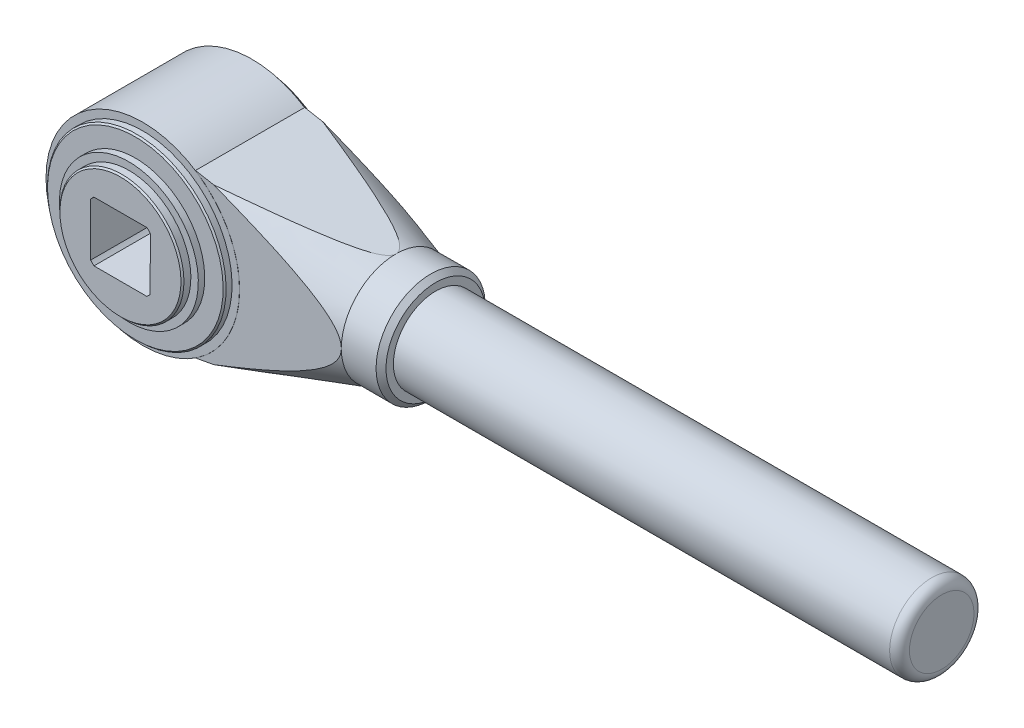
ISO-10303-21;
HEADER;
FILE_DESCRIPTION(('STEP AP214'),'2;1');
FILE_NAME('part.step','',(''),(''),'','','');
FILE_SCHEMA(('AUTOMOTIVE_DESIGN { 1 0 10303 214 1 1 1 1 }'));
ENDSEC;
DATA;
#1=APPLICATION_CONTEXT('core data for automotive mechanical design processes');
#2=APPLICATION_PROTOCOL_DEFINITION('international standard','automotive_design',2000,#1);
#3=PRODUCT_CONTEXT('',#1,'mechanical');
#4=PRODUCT('Part','Part','',(#3));
#5=PRODUCT_RELATED_PRODUCT_CATEGORY('part','',(#4));
#6=PRODUCT_DEFINITION_FORMATION('','',#4);
#7=PRODUCT_DEFINITION_CONTEXT('part definition',#1,'design');
#8=PRODUCT_DEFINITION('design','',#6,#7);
#9=PRODUCT_DEFINITION_SHAPE('','',#8);
#10=(LENGTH_UNIT() NAMED_UNIT(*) SI_UNIT(.MILLI.,.METRE.));
#11=(NAMED_UNIT(*) PLANE_ANGLE_UNIT() SI_UNIT($,.RADIAN.));
#12=(NAMED_UNIT(*) SI_UNIT($,.STERADIAN.) SOLID_ANGLE_UNIT());
#13=UNCERTAINTY_MEASURE_WITH_UNIT(LENGTH_MEASURE(1.E-05),#10,'distance_accuracy_value','');
#14=(GEOMETRIC_REPRESENTATION_CONTEXT(3) GLOBAL_UNCERTAINTY_ASSIGNED_CONTEXT((#13)) GLOBAL_UNIT_ASSIGNED_CONTEXT((#10,
#11,#12)) REPRESENTATION_CONTEXT('',''));
#15=CARTESIAN_POINT('',(0.,0.,0.));
#16=DIRECTION('',(0.,0.,1.));
#17=DIRECTION('',(1.,0.,0.));
#18=AXIS2_PLACEMENT_3D('',#15,#16,#17);
#19=CARTESIAN_POINT('',(0.,0.,26.4812474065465));
#20=DIRECTION('',(0.,0.,-1.));
#21=DIRECTION('',(-1.,0.,0.));
#22=AXIS2_PLACEMENT_3D('',#19,#20,#21);
#23=CYLINDRICAL_SURFACE('',#22,18.);
#24=CARTESIAN_POINT('',(0.,0.,4.5));
#25=DIRECTION('',(0.,0.,1.));
#26=DIRECTION('',(0.,-1.,0.));
#27=AXIS2_PLACEMENT_3D('',#24,#25,#26);
#28=CIRCLE('',#27,18.);
#29=CARTESIAN_POINT('',(3.2303662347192,17.7077591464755,4.5));
#30=VERTEX_POINT('',#29);
#31=CARTESIAN_POINT('',(3.2303662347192,-17.7077591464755,4.4999999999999));
#32=VERTEX_POINT('',#31);
#33=EDGE_CURVE('E245',#30,#32,#28,.T.);
#34=ORIENTED_EDGE('',*,*,#33,.F.);
#35=DIRECTION('',(0.,0.,-1.));
#36=VECTOR('',#35,1.);
#37=CARTESIAN_POINT('',(3.23036439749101,17.7077594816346,26.4812474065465));
#38=LINE('',#37,#36);
#39=CARTESIAN_POINT('',(3.23036439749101,17.7077594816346,4.4812474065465));
#40=VERTEX_POINT('',#39);
#41=EDGE_CURVE('E337',#30,#40,#38,.T.);
#42=ORIENTED_EDGE('',*,*,#41,.T.);
#43=CARTESIAN_POINT('',(0.,0.,4.4812474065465));
#44=DIRECTION('',(0.,0.,1.));
#45=DIRECTION('',(1.,0.,0.));
#46=AXIS2_PLACEMENT_3D('',#43,#44,#45);
#47=CIRCLE('',#46,18.);
#48=CARTESIAN_POINT('',(3.2303662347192,-17.7077591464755,4.4812474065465));
#49=VERTEX_POINT('',#48);
#50=EDGE_CURVE('E361',#49,#40,#47,.T.);
#51=ORIENTED_EDGE('',*,*,#50,.F.);
#52=DIRECTION('',(0.,0.,-1.));
#53=VECTOR('',#52,1.);
#54=CARTESIAN_POINT('',(3.23036810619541,-17.7077588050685,26.4812474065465));
#55=LINE('',#54,#53);
#56=EDGE_CURVE('E339',#32,#49,#55,.T.);
#57=ORIENTED_EDGE('',*,*,#56,.F.);
#58=EDGE_LOOP('',(#34,#42,#51,#57));
#59=FACE_BOUND('',#58,.T.);
#60=CARTESIAN_POINT('',(0.,0.,3.3));
#61=DIRECTION('',(0.,0.,1.));
#62=DIRECTION('',(0.,-1.,0.));
#63=AXIS2_PLACEMENT_3D('',#60,#61,#62);
#64=CIRCLE('',#63,18.);
#65=CARTESIAN_POINT('',(0.,-18.,3.29999999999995));
#66=VERTEX_POINT('',#65);
#67=EDGE_CURVE('E270',#66,#66,#64,.T.);
#68=ORIENTED_EDGE('',*,*,#67,.T.);
#69=EDGE_LOOP('',(#68));
#70=FACE_BOUND('',#69,.T.);
#71=ADVANCED_FACE('F14',(#59,#70),#23,.T.);
#72=CARTESIAN_POINT('',(40.,-11.,26.4812474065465));
#73=DIRECTION('',(0.179464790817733,-0.983764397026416,0.));
#74=DIRECTION('',(0.983764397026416,0.179464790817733,0.));
#75=AXIS2_PLACEMENT_3D('',#72,#73,#74);
#76=PLANE('',#75);
#77=CARTESIAN_POINT('',(14.2876747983,-15.690611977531,26.4814474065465));
#78=CARTESIAN_POINT('',(14.8657677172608,-15.5851524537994,26.3121760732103));
#79=CARTESIAN_POINT('',(15.4436485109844,-15.4797316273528,26.1421538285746));
#80=CARTESIAN_POINT('',(16.5989075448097,-15.2689816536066,25.8003404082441));
#81=CARTESIAN_POINT('',(17.1762857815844,-15.1636525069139,25.6285492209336));
#82=CARTESIAN_POINT('',(18.3305813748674,-14.9530782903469,25.2828948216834));
#83=CARTESIAN_POINT('',(18.9074986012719,-14.847833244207,25.1090311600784));
#84=CARTESIAN_POINT('',(20.0606272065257,-14.6374719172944,24.7589110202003));
#85=CARTESIAN_POINT('',(20.63683858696,-14.5323556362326,24.5826545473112));
#86=CARTESIAN_POINT('',(22.3698208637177,-14.2162135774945,24.047984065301));
#87=CARTESIAN_POINT('',(23.5253396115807,-14.0054162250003,23.6853377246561));
#88=CARTESIAN_POINT('',(25.2547260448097,-13.6899301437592,23.129072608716));
#89=CARTESIAN_POINT('',(25.8305105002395,-13.5848917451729,22.9416114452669));
#90=CARTESIAN_POINT('',(26.9804370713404,-13.3751145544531,22.561562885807));
#91=CARTESIAN_POINT('',(27.5545792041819,-13.2703757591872,22.3689755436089));
#92=CARTESIAN_POINT('',(28.7001266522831,-13.0613974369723,21.977542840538));
#93=CARTESIAN_POINT('',(29.2715342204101,-12.9571574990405,21.7787043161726));
#94=CARTESIAN_POINT('',(30.4115323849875,-12.7491915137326,21.3726158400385));
#95=CARTESIAN_POINT('',(30.9801226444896,-12.6454655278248,21.1653649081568));
#96=CARTESIAN_POINT('',(32.1124794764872,-12.4388935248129,20.7399036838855));
#97=CARTESIAN_POINT('',(32.6762515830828,-12.3360464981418,20.5217087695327));
#98=CARTESIAN_POINT('',(33.5171917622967,-12.1826366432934,20.1825007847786));
#99=CARTESIAN_POINT('',(33.7966890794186,-12.1316488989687,20.0674585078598));
#100=CARTESIAN_POINT('',(34.3536854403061,-12.0300379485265,19.8324884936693));
#101=CARTESIAN_POINT('',(34.63118455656,-11.9794147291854,19.7125609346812));
#102=CARTESIAN_POINT('',(35.1839961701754,-11.8785671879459,19.4664519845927));
#103=CARTESIAN_POINT('',(35.4593047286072,-11.828343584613,19.3402614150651));
#104=CARTESIAN_POINT('',(36.0064699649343,-11.7285260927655,19.0800636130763));
#105=CARTESIAN_POINT('',(36.2783254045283,-11.6789324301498,18.9460536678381));
#106=CARTESIAN_POINT('',(36.8178084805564,-11.5805163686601,18.6673153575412));
#107=CARTESIAN_POINT('',(37.0854194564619,-11.5316970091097,18.5225534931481));
#108=CARTESIAN_POINT('',(37.61269896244,-11.4355072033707,18.2189273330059));
#109=CARTESIAN_POINT('',(37.8723737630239,-11.3881356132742,18.0600745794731));
#110=CARTESIAN_POINT('',(38.2531865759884,-11.3186652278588,17.8052799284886));
#111=CARTESIAN_POINT('',(38.3793205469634,-11.2956550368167,17.7170825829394));
#112=CARTESIAN_POINT('',(38.6267893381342,-11.2505101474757,17.5340239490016));
#113=CARTESIAN_POINT('',(38.7481262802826,-11.2283750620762,17.4391656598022));
#114=CARTESIAN_POINT('',(38.9832571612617,-11.1854809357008,17.2416086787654));
#115=CARTESIAN_POINT('',(39.0970934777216,-11.1647141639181,17.1389626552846));
#116=CARTESIAN_POINT('',(39.3144892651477,-11.1250553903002,16.9231039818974));
#117=CARTESIAN_POINT('',(39.418069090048,-11.1061596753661,16.8099131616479));
#118=CARTESIAN_POINT('',(39.579174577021,-11.076769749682,16.6075331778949));
#119=CARTESIAN_POINT('',(39.6409743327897,-11.0654958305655,16.521903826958));
#120=CARTESIAN_POINT('',(39.7537932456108,-11.0449146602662,16.3433545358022));
#121=CARTESIAN_POINT('',(39.8048059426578,-11.0356085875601,16.2504302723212));
#122=CARTESIAN_POINT('',(39.8923263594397,-11.0196425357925,16.0557829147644));
#123=CARTESIAN_POINT('',(39.9285975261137,-11.0130257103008,15.9539459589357));
#124=CARTESIAN_POINT('',(39.9802071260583,-11.0036107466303,15.745005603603));
#125=CARTESIAN_POINT('',(39.9956120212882,-11.0008004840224,15.637920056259));
#126=CARTESIAN_POINT('',(40.0022560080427,-10.9995884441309,15.4380817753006));
#127=CARTESIAN_POINT('',(39.996586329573,-11.000622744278,15.3454292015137));
#128=CARTESIAN_POINT('',(39.9686765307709,-11.0057142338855,15.1626863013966));
#129=CARTESIAN_POINT('',(39.9464098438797,-11.0097762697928,15.0726003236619));
#130=CARTESIAN_POINT('',(39.8803825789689,-11.0218213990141,14.8742077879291));
#131=CARTESIAN_POINT('',(39.8325062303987,-11.0305553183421,14.7673494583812));
#132=CARTESIAN_POINT('',(39.7211167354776,-11.0508757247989,14.5625253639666));
#133=CARTESIAN_POINT('',(39.6575729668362,-11.0624677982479,14.4645775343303));
#134=CARTESIAN_POINT('',(39.5233951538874,-11.086945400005,14.2817711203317));
#135=CARTESIAN_POINT('',(39.4532955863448,-11.0997334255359,14.1964980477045));
#136=CARTESIAN_POINT('',(39.3062574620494,-11.1265570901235,14.0322162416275));
#137=CARTESIAN_POINT('',(39.2293121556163,-11.1405939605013,13.9532138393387));
#138=CARTESIAN_POINT('',(39.0702453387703,-11.1696119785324,13.8002664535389));
#139=CARTESIAN_POINT('',(38.9881068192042,-11.1845962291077,13.7263399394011));
#140=CARTESIAN_POINT('',(38.8201952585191,-11.2152277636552,13.5830111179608));
#141=CARTESIAN_POINT('',(38.7344240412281,-11.2308747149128,13.5136065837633));
#142=CARTESIAN_POINT('',(38.4791559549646,-11.2774424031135,13.3158261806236));
#143=CARTESIAN_POINT('',(38.3058605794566,-11.3090560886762,13.1925265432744));
#144=CARTESIAN_POINT('',(37.9526531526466,-11.3734905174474,12.9560663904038));
#145=CARTESIAN_POINT('',(37.7727363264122,-11.4063121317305,12.8429134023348));
#146=CARTESIAN_POINT('',(37.4080001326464,-11.4728497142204,12.6241589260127));
#147=CARTESIAN_POINT('',(37.2231707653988,-11.5065675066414,12.5185747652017));
#148=CARTESIAN_POINT('',(36.8502447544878,-11.5745991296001,12.3135370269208));
#149=CARTESIAN_POINT('',(36.6621477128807,-11.6089130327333,12.2140842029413));
#150=CARTESIAN_POINT('',(36.2817716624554,-11.6783037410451,12.0192290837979));
#151=CARTESIAN_POINT('',(36.0894701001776,-11.7133846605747,11.9238724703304));
#152=CARTESIAN_POINT('',(35.7029329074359,-11.7838993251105,11.737281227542));
#153=CARTESIAN_POINT('',(35.5086971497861,-11.819333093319,11.6460468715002));
#154=CARTESIAN_POINT('',(35.1190050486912,-11.8904232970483,11.4671625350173));
#155=CARTESIAN_POINT('',(34.9235510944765,-11.9260792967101,11.3795071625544));
#156=CARTESIAN_POINT('',(34.5314138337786,-11.9976155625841,11.2071124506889));
#157=CARTESIAN_POINT('',(34.3347305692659,-12.0334958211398,11.1223730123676));
#158=CARTESIAN_POINT('',(33.7209239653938,-12.1454704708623,10.8624609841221));
#159=CARTESIAN_POINT('',(33.3020396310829,-12.2218861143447,10.6915834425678));
#160=CARTESIAN_POINT('',(32.4610972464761,-12.3752963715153,10.3580727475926));
#161=CARTESIAN_POINT('',(32.0390389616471,-12.4522910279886,10.1954402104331));
#162=CARTESIAN_POINT('',(31.192491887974,-12.6067237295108,9.87654898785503));
#163=CARTESIAN_POINT('',(30.7680025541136,-12.6841618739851,9.72029180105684));
#164=CARTESIAN_POINT('',(29.9172322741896,-12.8393650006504,9.41289200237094));
#165=CARTESIAN_POINT('',(29.490951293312,-12.9171299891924,9.2617494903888));
#166=CARTESIAN_POINT('',(28.2085294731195,-13.1510778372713,8.81399293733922));
#167=CARTESIAN_POINT('',(27.350288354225,-13.3076438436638,8.52359832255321));
#168=CARTESIAN_POINT('',(25.6302801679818,-13.6214190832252,7.9543189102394));
#169=CARTESIAN_POINT('',(24.7685136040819,-13.7786282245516,7.67543252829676));
#170=CARTESIAN_POINT('',(23.105984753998,-14.0819177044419,7.14633474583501));
#171=CARTESIAN_POINT('',(22.3054064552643,-14.2279644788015,6.89552466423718));
#172=CARTESIAN_POINT('',(20.7025389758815,-14.5203701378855,6.39950020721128));
#173=CARTESIAN_POINT('',(19.9002497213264,-14.6667290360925,6.15428607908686));
#174=CARTESIAN_POINT('',(18.2968038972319,-14.9592402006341,5.66903041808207));
#175=CARTESIAN_POINT('',(17.4956512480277,-15.1053917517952,5.42897547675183));
#176=CARTESIAN_POINT('',(15.8923556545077,-15.3978755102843,4.95249364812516));
#177=CARTESIAN_POINT('',(15.0902127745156,-15.5442077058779,4.71606653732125));
#178=CARTESIAN_POINT('',(14.2876747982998,-15.690611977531,4.48104740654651));
#179=B_SPLINE_CURVE_WITH_KNOTS('',3,(#77,#78,#79,#80,#81,#82,#83,#84,#85,#86,#87,#88,#89,#90,
#91,#92,#93,#94,#95,#96,#97,#98,#99,#100,#101,#102,#103,#104,#105,#106,#107,#108,#109,#110,#111,
#112,#113,#114,#115,#116,#117,#118,#119,#120,#121,#122,#123,#124,#125,#126,#127,#128,#129,#130,
#131,#132,#133,#134,#135,#136,#137,#138,#139,#140,#141,#142,#143,#144,#145,#146,#147,#148,#149,
#150,#151,#152,#153,#154,#155,#156,#157,#158,#159,#160,#161,#162,#163,#164,#165,#166,#167,#168,
#169,#170,#171,#172,#173,#174,#175,#176,#177,#178),.UNSPECIFIED.,.F.,.F.,(4,2,2,2,2,2,2,2,2,2,2,
2,2,2,2,2,2,2,2,2,2,2,2,2,2,2,2,2,2,2,2,2,2,2,2,2,2,2,2,2,2,2,2,2,2,2,2,2,2,2,4),(0.,
1.83458293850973,3.66917793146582,5.50417849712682,7.33917493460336,11.0269641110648,
12.8706718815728,14.7143603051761,16.5560981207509,18.3980511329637,20.2374847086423,
21.1570041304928,22.0764900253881,22.9973656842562,23.9185627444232,24.8427611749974,
25.7662094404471,26.2329177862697,26.6994173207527,27.163003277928,27.6256499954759,
27.9436549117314,28.261849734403,28.5849660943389,28.9070508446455,29.1838821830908,
29.4611575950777,29.8114427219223,30.162417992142,30.4952976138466,30.8285091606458,
31.1628751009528,31.4970751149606,32.1415636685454,32.786526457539,33.432921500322,
34.0793958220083,34.7318176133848,35.3842825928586,36.0357252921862,36.687145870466,
38.0634287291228,39.4398143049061,40.816521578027,42.1932557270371,44.9515229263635,
47.7094091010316,50.264074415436,52.8188524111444,55.3658985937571,57.9127872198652),.UNSPECIFIED.);
#180=CARTESIAN_POINT('',(14.2883578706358,-15.6904873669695,26.4812474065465));
#181=VERTEX_POINT('',#180);
#182=CARTESIAN_POINT('',(40.,-11.,15.4812474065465));
#183=VERTEX_POINT('',#182);
#184=EDGE_CURVE('E244',#181,#183,#179,.T.);
#185=ORIENTED_EDGE('',*,*,#184,.F.);
#186=DIRECTION('',(-0.983764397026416,-0.179464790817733,0.));
#187=VECTOR('',#186,1.);
#188=CARTESIAN_POINT('',(40.,-11.,26.4812474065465));
#189=LINE('',#188,#187);
#190=CARTESIAN_POINT('',(10.6085992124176,-16.3617732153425,26.4812474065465));
#191=VERTEX_POINT('',#190);
#192=EDGE_CURVE('E333',#181,#191,#189,.T.);
#193=ORIENTED_EDGE('',*,*,#192,.T.);
#194=DIRECTION('',(0.,0.,1.));
#195=VECTOR('',#194,1.);
#196=CARTESIAN_POINT('',(10.6085992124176,-16.3617732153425,36.));
#197=LINE('',#196,#195);
#198=CARTESIAN_POINT('',(10.6085992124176,-16.361773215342,4.4999999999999));
#199=VERTEX_POINT('',#198);
#200=EDGE_CURVE('E323',#191,#199,#197,.F.);
#201=ORIENTED_EDGE('',*,*,#200,.T.);
#202=DIRECTION('',(-0.983764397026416,-0.179464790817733,0.));
#203=VECTOR('',#202,1.);
#204=CARTESIAN_POINT('',(40.,-11.,4.4999999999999));
#205=LINE('',#204,#203);
#206=EDGE_CURVE('E326',#199,#32,#205,.T.);
#207=ORIENTED_EDGE('',*,*,#206,.T.);
#208=ORIENTED_EDGE('',*,*,#56,.T.);
#209=DIRECTION('',(-0.983764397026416,-0.179464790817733,0.));
#210=VECTOR('',#209,1.);
#211=CARTESIAN_POINT('',(40.,-11.,4.4812474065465));
#212=LINE('',#211,#210);
#213=CARTESIAN_POINT('',(14.2883578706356,-15.6904873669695,4.4812474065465));
#214=VERTEX_POINT('',#213);
#215=EDGE_CURVE('E329',#214,#49,#212,.T.);
#216=ORIENTED_EDGE('',*,*,#215,.F.);
#217=EDGE_CURVE('E211',#183,#214,#179,.T.);
#218=ORIENTED_EDGE('',*,*,#217,.F.);
#219=EDGE_LOOP('',(#185,#193,#201,#207,#208,#216,#218));
#220=FACE_BOUND('',#219,.T.);
#221=ADVANCED_FACE('F255',(#220),#76,.T.);
#222=CARTESIAN_POINT('',(40.,11.,26.4812474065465));
#223=DIRECTION('',(-0.179464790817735,-0.983764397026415,0.));
#224=DIRECTION('',(0.983764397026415,-0.179464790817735,0.));
#225=AXIS2_PLACEMENT_3D('',#222,#223,#224);
#226=PLANE('',#225);
#227=DIRECTION('',(-0.983764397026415,0.179464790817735,0.));
#228=VECTOR('',#227,1.);
#229=CARTESIAN_POINT('',(40.,11.,26.4812474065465));
#230=LINE('',#229,#228);
#231=CARTESIAN_POINT('',(14.2883578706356,15.6904873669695,26.4812474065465));
#232=VERTEX_POINT('',#231);
#233=CARTESIAN_POINT('',(10.6085992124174,16.3617732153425,26.4812474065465));
#234=VERTEX_POINT('',#233);
#235=EDGE_CURVE('E335',#232,#234,#230,.T.);
#236=ORIENTED_EDGE('',*,*,#235,.F.);
#237=CARTESIAN_POINT('',(14.2876747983,15.690611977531,26.4814474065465));
#238=CARTESIAN_POINT('',(14.8657677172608,15.5851524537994,26.3121760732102));
#239=CARTESIAN_POINT('',(15.4436485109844,15.4797316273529,26.1421538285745));
#240=CARTESIAN_POINT('',(16.5989075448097,15.2689816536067,25.800340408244));
#241=CARTESIAN_POINT('',(17.1762857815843,15.163652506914,25.6285492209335));
#242=CARTESIAN_POINT('',(18.3305813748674,14.9530782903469,25.2828948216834));
#243=CARTESIAN_POINT('',(18.9074986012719,14.847833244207,25.1090311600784));
#244=CARTESIAN_POINT('',(20.0606272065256,14.6374719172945,24.7589110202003));
#245=CARTESIAN_POINT('',(20.6368385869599,14.5323556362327,24.5826545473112));
#246=CARTESIAN_POINT('',(22.3698208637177,14.2162135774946,24.047984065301));
#247=CARTESIAN_POINT('',(23.5253396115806,14.0054162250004,23.6853377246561));
#248=CARTESIAN_POINT('',(25.2547260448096,13.6899301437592,23.1290726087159));
#249=CARTESIAN_POINT('',(25.8305105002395,13.5848917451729,22.9416114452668));
#250=CARTESIAN_POINT('',(26.9804370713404,13.3751145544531,22.561562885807));
#251=CARTESIAN_POINT('',(27.5545792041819,13.2703757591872,22.3689755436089));
#252=CARTESIAN_POINT('',(28.7001266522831,13.0613974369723,21.9775428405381));
#253=CARTESIAN_POINT('',(29.2715342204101,12.9571574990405,21.7787043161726));
#254=CARTESIAN_POINT('',(30.4115323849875,12.7491915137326,21.3726158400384));
#255=CARTESIAN_POINT('',(30.9801226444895,12.6454655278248,21.1653649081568));
#256=CARTESIAN_POINT('',(32.1124794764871,12.4388935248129,20.7399036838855));
#257=CARTESIAN_POINT('',(32.6762515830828,12.3360464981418,20.5217087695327));
#258=CARTESIAN_POINT('',(33.5171917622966,12.1826366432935,20.1825007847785));
#259=CARTESIAN_POINT('',(33.7966890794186,12.1316488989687,20.0674585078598));
#260=CARTESIAN_POINT('',(34.3536854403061,12.0300379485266,19.8324884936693));
#261=CARTESIAN_POINT('',(34.63118455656,11.9794147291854,19.7125609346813));
#262=CARTESIAN_POINT('',(35.1839961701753,11.8785671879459,19.4664519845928));
#263=CARTESIAN_POINT('',(35.4593047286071,11.8283435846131,19.3402614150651));
#264=CARTESIAN_POINT('',(36.0064699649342,11.7285260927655,19.0800636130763));
#265=CARTESIAN_POINT('',(36.2783254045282,11.6789324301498,18.9460536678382));
#266=CARTESIAN_POINT('',(36.8178084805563,11.5805163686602,18.6673153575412));
#267=CARTESIAN_POINT('',(37.0854194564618,11.5316970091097,18.5225534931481));
#268=CARTESIAN_POINT('',(37.61269896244,11.4355072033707,18.2189273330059));
#269=CARTESIAN_POINT('',(37.8723737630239,11.3881356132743,18.0600745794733));
#270=CARTESIAN_POINT('',(38.2531865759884,11.3186652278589,17.8052799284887));
#271=CARTESIAN_POINT('',(38.3793205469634,11.2956550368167,17.7170825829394));
#272=CARTESIAN_POINT('',(38.6267893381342,11.2505101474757,17.5340239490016));
#273=CARTESIAN_POINT('',(38.7481262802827,11.2283750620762,17.4391656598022));
#274=CARTESIAN_POINT('',(38.9832571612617,11.1854809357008,17.2416086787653));
#275=CARTESIAN_POINT('',(39.0970934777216,11.1647141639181,17.1389626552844));
#276=CARTESIAN_POINT('',(39.3144892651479,11.1250553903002,16.9231039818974));
#277=CARTESIAN_POINT('',(39.4180690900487,11.106159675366,16.8099131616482));
#278=CARTESIAN_POINT('',(39.5791745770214,11.076769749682,16.607533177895));
#279=CARTESIAN_POINT('',(39.6409743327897,11.0654958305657,16.5219038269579));
#280=CARTESIAN_POINT('',(39.7537932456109,11.044914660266,16.3433545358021));
#281=CARTESIAN_POINT('',(39.8048059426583,11.0356085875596,16.2504302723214));
#282=CARTESIAN_POINT('',(39.8923263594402,11.019642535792,16.0557829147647));
#283=CARTESIAN_POINT('',(39.9285975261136,11.0130257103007,15.9539459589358));
#284=CARTESIAN_POINT('',(39.9802071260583,11.0036107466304,15.745005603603));
#285=CARTESIAN_POINT('',(39.9956120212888,11.0008004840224,15.6379200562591));
#286=CARTESIAN_POINT('',(40.0022560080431,10.9995884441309,15.4380817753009));
#287=CARTESIAN_POINT('',(39.9965863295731,11.000622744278,15.345429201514));
#288=CARTESIAN_POINT('',(39.9686765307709,11.0057142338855,15.1626863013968));
#289=CARTESIAN_POINT('',(39.9464098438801,11.0097762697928,15.0726003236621));
#290=CARTESIAN_POINT('',(39.8803825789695,11.0218213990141,14.8742077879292));
#291=CARTESIAN_POINT('',(39.832506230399,11.0305553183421,14.7673494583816));
#292=CARTESIAN_POINT('',(39.7211167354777,11.0508757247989,14.5625253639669));
#293=CARTESIAN_POINT('',(39.6575729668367,11.0624677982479,14.4645775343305));
#294=CARTESIAN_POINT('',(39.523395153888,11.086945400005,14.281771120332));
#295=CARTESIAN_POINT('',(39.4532955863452,11.0997334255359,14.1964980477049));
#296=CARTESIAN_POINT('',(39.3062574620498,11.1265570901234,14.032216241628));
#297=CARTESIAN_POINT('',(39.2293121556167,11.1405939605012,13.9532138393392));
#298=CARTESIAN_POINT('',(39.0702453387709,11.1696119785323,13.8002664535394));
#299=CARTESIAN_POINT('',(38.9881068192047,11.1845962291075,13.7263399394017));
#300=CARTESIAN_POINT('',(38.8201952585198,11.2152277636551,13.5830111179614));
#301=CARTESIAN_POINT('',(38.734424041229,11.2308747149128,13.5136065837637));
#302=CARTESIAN_POINT('',(38.4791559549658,11.2774424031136,13.315826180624));
#303=CARTESIAN_POINT('',(38.3058605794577,11.309056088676,13.1925265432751));
#304=CARTESIAN_POINT('',(37.9526531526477,11.3734905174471,12.9560663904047));
#305=CARTESIAN_POINT('',(37.7727363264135,11.4063121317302,12.8429134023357));
#306=CARTESIAN_POINT('',(37.408000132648,11.4728497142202,12.6241589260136));
#307=CARTESIAN_POINT('',(37.2231707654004,11.5065675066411,12.5185747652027));
#308=CARTESIAN_POINT('',(36.8502447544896,11.5745991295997,12.3135370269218));
#309=CARTESIAN_POINT('',(36.6621477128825,11.6089130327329,12.2140842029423));
#310=CARTESIAN_POINT('',(36.2817716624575,11.6783037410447,12.0192290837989));
#311=CARTESIAN_POINT('',(36.0894701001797,11.7133846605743,11.9238724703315));
#312=CARTESIAN_POINT('',(35.7029329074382,11.7838993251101,11.7372812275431));
#313=CARTESIAN_POINT('',(35.5086971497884,11.8193330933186,11.6460468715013));
#314=CARTESIAN_POINT('',(35.1190050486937,11.8904232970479,11.4671625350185));
#315=CARTESIAN_POINT('',(34.9235510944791,11.9260792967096,11.3795071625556));
#316=CARTESIAN_POINT('',(34.5314138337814,11.9976155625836,11.2071124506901));
#317=CARTESIAN_POINT('',(34.3347305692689,12.0334958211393,11.1223730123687));
#318=CARTESIAN_POINT('',(33.7209239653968,12.1454704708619,10.862460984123));
#319=CARTESIAN_POINT('',(33.3020396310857,12.2218861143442,10.6915834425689));
#320=CARTESIAN_POINT('',(32.4610972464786,12.3752963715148,10.3580727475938));
#321=CARTESIAN_POINT('',(32.0390389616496,12.4522910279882,10.1954402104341));
#322=CARTESIAN_POINT('',(31.1924918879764,12.6067237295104,9.87654898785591));
#323=CARTESIAN_POINT('',(30.7680025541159,12.6841618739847,9.72029180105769));
#324=CARTESIAN_POINT('',(29.9172322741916,12.8393650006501,9.41289200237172));
#325=CARTESIAN_POINT('',(29.4909512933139,12.9171299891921,9.26174949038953));
#326=CARTESIAN_POINT('',(28.2085294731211,13.151077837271,8.81399293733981));
#327=CARTESIAN_POINT('',(27.3502883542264,13.3076438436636,8.52359832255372));
#328=CARTESIAN_POINT('',(25.6302801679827,13.6214190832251,7.95431891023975));
#329=CARTESIAN_POINT('',(24.7685136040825,13.7786282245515,7.67543252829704));
#330=CARTESIAN_POINT('',(23.1059847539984,14.0819177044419,7.14633474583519));
#331=CARTESIAN_POINT('',(22.3054064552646,14.2279644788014,6.89552466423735));
#332=CARTESIAN_POINT('',(20.7025389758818,14.5203701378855,6.39950020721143));
#333=CARTESIAN_POINT('',(19.9002497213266,14.6667290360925,6.154286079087));
#334=CARTESIAN_POINT('',(18.2968038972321,14.9592402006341,5.6690304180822));
#335=CARTESIAN_POINT('',(17.4956512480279,15.1053917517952,5.42897547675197));
#336=CARTESIAN_POINT('',(15.8923556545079,15.3978755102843,4.95249364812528));
#337=CARTESIAN_POINT('',(15.0902127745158,15.5442077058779,4.71606653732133));
#338=CARTESIAN_POINT('',(14.2876747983,15.690611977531,4.48104740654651));
#339=B_SPLINE_CURVE_WITH_KNOTS('',3,(#237,#238,#239,#240,#241,#242,#243,#244,#245,#246,#247,
#248,#249,#250,#251,#252,#253,#254,#255,#256,#257,#258,#259,#260,#261,#262,#263,#264,#265,#266,
#267,#268,#269,#270,#271,#272,#273,#274,#275,#276,#277,#278,#279,#280,#281,#282,#283,#284,#285,
#286,#287,#288,#289,#290,#291,#292,#293,#294,#295,#296,#297,#298,#299,#300,#301,#302,#303,#304,
#305,#306,#307,#308,#309,#310,#311,#312,#313,#314,#315,#316,#317,#318,#319,#320,#321,#322,#323,
#324,#325,#326,#327,#328,#329,#330,#331,#332,#333,#334,#335,#336,#337,#338),.UNSPECIFIED.,.F.,
.F.,(4,2,2,2,2,2,2,2,2,2,2,2,2,2,2,2,2,2,2,2,2,2,2,2,2,2,2,2,2,2,2,2,2,2,2,2,2,2,2,2,2,2,2,2,2,
2,2,2,2,2,4),(0.,1.8345829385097,3.66917793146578,5.50417849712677,7.3391749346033,
11.0269641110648,12.8706718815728,14.714360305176,16.5560981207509,18.3980511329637,
20.2374847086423,21.1570041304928,22.0764900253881,22.9973656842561,23.9185627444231,
24.8427611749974,25.7662094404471,26.2329177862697,26.6994173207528,27.1630032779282,
27.6256499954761,27.9436549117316,28.2618497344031,28.584966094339,28.9070508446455,
29.1838821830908,29.4611575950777,29.8114427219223,30.1624179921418,30.4952976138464,
30.8285091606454,31.1628751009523,31.4970751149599,32.1415636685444,32.7865264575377,
33.4329215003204,34.0793958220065,34.7318176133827,35.3842825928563,36.0357252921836,
36.6871458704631,38.0634287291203,39.4398143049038,40.816521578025,42.1932557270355,
44.9515229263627,47.7094091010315,50.264074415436,52.8188524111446,55.3658985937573,
57.9127872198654),.UNSPECIFIED.);
#340=CARTESIAN_POINT('',(40.,11.,15.4812474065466));
#341=VERTEX_POINT('',#340);
#342=EDGE_CURVE('E210',#232,#341,#339,.T.);
#343=ORIENTED_EDGE('',*,*,#342,.T.);
#344=CARTESIAN_POINT('',(14.2883578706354,15.6904873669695,4.4812474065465));
#345=VERTEX_POINT('',#344);
#346=EDGE_CURVE('E202',#341,#345,#339,.T.);
#347=ORIENTED_EDGE('',*,*,#346,.T.);
#348=DIRECTION('',(-0.983764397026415,0.179464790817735,0.));
#349=VECTOR('',#348,1.);
#350=CARTESIAN_POINT('',(40.,11.,4.4812474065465));
#351=LINE('',#350,#349);
#352=EDGE_CURVE('E331',#345,#40,#351,.T.);
#353=ORIENTED_EDGE('',*,*,#352,.T.);
#354=ORIENTED_EDGE('',*,*,#41,.F.);
#355=DIRECTION('',(-0.983764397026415,0.179464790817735,0.));
#356=VECTOR('',#355,1.);
#357=CARTESIAN_POINT('',(40.,11.,4.5));
#358=LINE('',#357,#356);
#359=CARTESIAN_POINT('',(10.6085992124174,16.3617732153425,4.5));
#360=VERTEX_POINT('',#359);
#361=EDGE_CURVE('E366',#360,#30,#358,.T.);
#362=ORIENTED_EDGE('',*,*,#361,.F.);
#363=DIRECTION('',(0.,0.,1.));
#364=VECTOR('',#363,1.);
#365=CARTESIAN_POINT('',(10.6085992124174,16.3617732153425,36.));
#366=LINE('',#365,#364);
#367=EDGE_CURVE('E321',#234,#360,#366,.F.);
#368=ORIENTED_EDGE('',*,*,#367,.F.);
#369=EDGE_LOOP('',(#236,#343,#347,#353,#354,#362,#368));
#370=FACE_BOUND('',#369,.T.);
#371=ADVANCED_FACE('F218',(#370),#226,.F.);
#372=CARTESIAN_POINT('',(0.,0.,26.4812474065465));
#373=DIRECTION('',(0.,0.,1.));
#374=DIRECTION('',(1.,0.,0.));
#375=AXIS2_PLACEMENT_3D('',#372,#373,#374);
#376=PLANE('',#375);
#377=CARTESIAN_POINT('',(-11.5582606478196,-25.059340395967,26.4812474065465));
#378=CARTESIAN_POINT('',(-10.4252381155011,-24.6665138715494,26.4812474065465));
#379=CARTESIAN_POINT('',(-9.2926652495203,-24.2723859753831,26.4812474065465));
#380=CARTESIAN_POINT('',(-7.02858891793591,-23.4810514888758,26.4812474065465));
#381=CARTESIAN_POINT('',(-5.89708545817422,-23.0838448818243,26.4812474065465));
#382=CARTESIAN_POINT('',(-3.63513818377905,-22.2858134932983,26.4812474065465));
#383=CARTESIAN_POINT('',(-2.50469458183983,-21.8849881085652,26.4812474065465));
#384=CARTESIAN_POINT('',(-0.245294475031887,-21.0791718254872,26.4812474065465));
#385=CARTESIAN_POINT('',(0.883662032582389,-20.6741809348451,26.4812474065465));
#386=CARTESIAN_POINT('',(3.14318993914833,-19.8580441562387,26.4812474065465));
#387=CARTESIAN_POINT('',(4.27375597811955,-19.4468834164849,26.4812474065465));
#388=CARTESIAN_POINT('',(6.53270876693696,-18.6186201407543,26.4812474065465));
#389=CARTESIAN_POINT('',(7.66109552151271,-18.2015176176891,26.4812474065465));
#390=CARTESIAN_POINT('',(9.9150943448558,-17.3601240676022,26.4812474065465));
#391=CARTESIAN_POINT('',(11.0407066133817,-16.9358335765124,26.4812474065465));
#392=CARTESIAN_POINT('',(13.2885230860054,-16.0783362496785,26.4812474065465));
#393=CARTESIAN_POINT('',(14.4107273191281,-15.6451294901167,26.4812474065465));
#394=CARTESIAN_POINT('',(16.6497380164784,-14.7678869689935,26.4812474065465));
#395=CARTESIAN_POINT('',(17.7665484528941,-14.3238613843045,26.4812474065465));
#396=CARTESIAN_POINT('',(19.437395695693,-13.646920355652,26.4812474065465));
#397=CARTESIAN_POINT('',(19.9936383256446,-13.4194471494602,26.4812474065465));
#398=CARTESIAN_POINT('',(21.1043894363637,-12.9603086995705,26.4812474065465));
#399=CARTESIAN_POINT('',(21.658897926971,-12.7286434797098,26.4812474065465));
#400=CARTESIAN_POINT('',(22.7655844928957,-12.260571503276,26.4812474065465));
#401=CARTESIAN_POINT('',(23.3177635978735,-12.0241671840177,26.4812474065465));
#402=CARTESIAN_POINT('',(24.4196486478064,-11.5456715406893,26.4812474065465));
#403=CARTESIAN_POINT('',(24.9693546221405,-11.3035802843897,26.4812474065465));
#404=CARTESIAN_POINT('',(26.065690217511,-10.8126767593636,26.4812474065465));
#405=CARTESIAN_POINT('',(26.6123201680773,-10.5638652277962,26.4812474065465));
#406=CARTESIAN_POINT('',(27.701812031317,-10.0581407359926,26.4812474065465));
#407=CARTESIAN_POINT('',(28.2446740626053,-9.80122803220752,26.4812474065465));
#408=CARTESIAN_POINT('',(29.1642518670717,-9.35565221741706,26.4812474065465));
#409=CARTESIAN_POINT('',(29.5421885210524,-9.16951001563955,26.4812474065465));
#410=CARTESIAN_POINT('',(30.2952118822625,-8.79151812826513,26.4812474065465));
#411=CARTESIAN_POINT('',(30.6702985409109,-8.5996683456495,26.4812474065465));
#412=CARTESIAN_POINT('',(31.4167911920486,-8.20933838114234,26.4812474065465));
#413=CARTESIAN_POINT('',(31.788198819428,-8.01086133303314,26.4812474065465));
#414=CARTESIAN_POINT('',(32.5266196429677,-7.60589516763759,26.4812474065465));
#415=CARTESIAN_POINT('',(32.8936330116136,-7.39940636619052,26.4812474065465));
#416=CARTESIAN_POINT('',(33.5576475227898,-7.01405626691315,26.4812474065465));
#417=CARTESIAN_POINT('',(33.8555569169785,-6.83676316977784,26.4812474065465));
#418=CARTESIAN_POINT('',(34.446563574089,-6.47434073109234,26.4812474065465));
#419=CARTESIAN_POINT('',(34.739661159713,-6.28921191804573,26.4812474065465));
#420=CARTESIAN_POINT('',(35.3203106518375,-5.90909871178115,26.4812474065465));
#421=CARTESIAN_POINT('',(35.6078494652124,-5.71409423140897,26.4812474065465));
#422=CARTESIAN_POINT('',(36.1747049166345,-5.3125010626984,26.4812474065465));
#423=CARTESIAN_POINT('',(36.454023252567,-5.10591479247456,26.4812474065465));
#424=CARTESIAN_POINT('',(36.9400499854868,-4.726216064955,26.4812474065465));
#425=CARTESIAN_POINT('',(37.1489982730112,-4.55598200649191,26.4812474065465));
#426=CARTESIAN_POINT('',(37.5580791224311,-4.20497941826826,26.4812474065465));
#427=CARTESIAN_POINT('',(37.7582080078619,-4.02420656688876,26.4812474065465));
#428=CARTESIAN_POINT('',(38.1457364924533,-3.65070218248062,26.4812474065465));
#429=CARTESIAN_POINT('',(38.3331784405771,-3.45801500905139,26.4812474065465));
#430=CARTESIAN_POINT('',(38.6912455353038,-3.05772957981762,26.4812474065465));
#431=CARTESIAN_POINT('',(38.8618891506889,-2.85014814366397,26.4812474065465));
#432=CARTESIAN_POINT('',(39.1649027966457,-2.43704221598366,26.4812474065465));
#433=CARTESIAN_POINT('',(39.2993442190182,-2.23305747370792,26.4812474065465));
#434=CARTESIAN_POINT('',(39.5407259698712,-1.80889883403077,26.4812474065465));
#435=CARTESIAN_POINT('',(39.6476725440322,-1.58872862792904,26.4812474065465));
#436=CARTESIAN_POINT('',(39.7803941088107,-1.24569738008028,26.4812474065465));
#437=CARTESIAN_POINT('',(39.8202232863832,-1.12822730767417,26.4812474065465));
#438=CARTESIAN_POINT('',(39.8887424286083,-0.890109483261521,26.4812474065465));
#439=CARTESIAN_POINT('',(39.9174392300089,-0.769463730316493,26.4812474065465));
#440=CARTESIAN_POINT('',(39.9624998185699,-0.526088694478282,26.4812474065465));
#441=CARTESIAN_POINT('',(39.9788851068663,-0.403363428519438,26.4812474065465));
#442=CARTESIAN_POINT('',(39.9986483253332,-0.156870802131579,26.4812474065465));
#443=CARTESIAN_POINT('',(40.0020284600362,-0.0331036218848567,26.4812474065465));
#444=CARTESIAN_POINT('',(39.9960867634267,0.1963178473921,26.4812474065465));
#445=CARTESIAN_POINT('',(39.9885190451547,0.302021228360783,26.4812474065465));
#446=CARTESIAN_POINT('',(39.9640169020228,0.512350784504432,26.4812474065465));
#447=CARTESIAN_POINT('',(39.9470795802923,0.616976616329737,26.4812474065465));
#448=CARTESIAN_POINT('',(39.8829451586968,0.928243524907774,26.4812474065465));
#449=CARTESIAN_POINT('',(39.8224279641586,1.13220412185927,26.4812474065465));
#450=CARTESIAN_POINT('',(39.6419057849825,1.60963342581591,26.4812474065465));
#451=CARTESIAN_POINT('',(39.5077162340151,1.87762821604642,26.4812474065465));
#452=CARTESIAN_POINT('',(39.2774372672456,2.26160288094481,26.4812474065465));
#453=CARTESIAN_POINT('',(39.1957003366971,2.38676608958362,26.4812474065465));
#454=CARTESIAN_POINT('',(39.0242335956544,2.6315172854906,26.4812474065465));
#455=CARTESIAN_POINT('',(38.9345048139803,2.75110598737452,26.4812474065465));
#456=CARTESIAN_POINT('',(38.7238208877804,3.01620459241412,26.4812474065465));
#457=CARTESIAN_POINT('',(38.6009087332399,3.16014711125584,26.4812474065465));
#458=CARTESIAN_POINT('',(38.3469324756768,3.44069760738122,26.4812474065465));
#459=CARTESIAN_POINT('',(38.2158650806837,3.57730258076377,26.4812474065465));
#460=CARTESIAN_POINT('',(37.9471083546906,3.84422286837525,26.4812474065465));
#461=CARTESIAN_POINT('',(37.8094091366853,3.97452817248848,26.4812474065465));
#462=CARTESIAN_POINT('',(37.5288326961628,4.22944646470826,26.4812474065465));
#463=CARTESIAN_POINT('',(37.3859548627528,4.35405877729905,26.4812474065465));
#464=CARTESIAN_POINT('',(37.0950237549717,4.59909334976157,26.4812474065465));
#465=CARTESIAN_POINT('',(36.9469422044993,4.7194819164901,26.4812474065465));
#466=CARTESIAN_POINT('',(36.6472635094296,4.95579524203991,26.4812474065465));
#467=CARTESIAN_POINT('',(36.4956662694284,5.07171987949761,26.4812474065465));
#468=CARTESIAN_POINT('',(36.1897005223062,5.29950171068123,26.4812474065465));
#469=CARTESIAN_POINT('',(36.0353350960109,5.41136305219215,26.4812474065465));
#470=CARTESIAN_POINT('',(35.7241358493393,5.63157665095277,26.4812474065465));
#471=CARTESIAN_POINT('',(35.5673021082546,5.73992902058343,26.4812474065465));
#472=CARTESIAN_POINT('',(35.0659073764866,6.07907838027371,26.4812474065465));
#473=CARTESIAN_POINT('',(34.7174119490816,6.30406865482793,26.4812474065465));
#474=CARTESIAN_POINT('',(34.0131290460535,6.74237646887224,26.4812474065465));
#475=CARTESIAN_POINT('',(33.6573401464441,6.95569169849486,26.4812474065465));
#476=CARTESIAN_POINT('',(32.9400207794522,7.37294095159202,26.4812474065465));
#477=CARTESIAN_POINT('',(32.578486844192,7.57686899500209,26.4812474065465));
#478=CARTESIAN_POINT('',(31.8510928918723,7.97686456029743,26.4812474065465));
#479=CARTESIAN_POINT('',(31.4852326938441,8.17293175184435,26.4812474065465));
#480=CARTESIAN_POINT('',(30.7491205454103,8.55896132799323,26.4812474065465));
#481=CARTESIAN_POINT('',(30.3788597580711,8.74890682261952,26.4812474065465));
#482=CARTESIAN_POINT('',(29.6355003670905,9.12316054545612,26.4812474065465));
#483=CARTESIAN_POINT('',(29.2624017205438,9.30746868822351,26.4812474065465));
#484=CARTESIAN_POINT('',(28.1398867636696,9.85303002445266,26.4812474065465));
#485=CARTESIAN_POINT('',(27.3869632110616,10.2070694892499,26.4812474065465));
#486=CARTESIAN_POINT('',(25.8723552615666,10.9015462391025,26.4812474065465));
#487=CARTESIAN_POINT('',(25.1106521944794,11.2419425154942,26.4812474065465));
#488=CARTESIAN_POINT('',(23.582163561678,11.9112786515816,26.4812474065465));
#489=CARTESIAN_POINT('',(22.815377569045,12.2402175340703,26.4812474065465));
#490=CARTESIAN_POINT('',(21.2791860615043,12.8883668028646,26.4812474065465));
#491=CARTESIAN_POINT('',(20.5097868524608,13.2075921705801,26.4812474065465));
#492=CARTESIAN_POINT('',(19.3534041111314,13.6807957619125,26.4812474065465));
#493=CARTESIAN_POINT('',(18.9675686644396,13.8375887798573,26.4812474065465));
#494=CARTESIAN_POINT('',(18.1952064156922,14.1494627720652,26.4812474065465));
#495=CARTESIAN_POINT('',(17.808679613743,14.3045437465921,26.4812474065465));
#496=CARTESIAN_POINT('',(16.6212968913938,14.7781683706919,26.4812474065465));
#497=CARTESIAN_POINT('',(15.8194207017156,15.094155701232,26.4812474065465));
#498=CARTESIAN_POINT('',(14.2134918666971,15.7205558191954,26.4812474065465));
#499=CARTESIAN_POINT('',(13.4094392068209,16.0309685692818,26.4812474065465));
#500=CARTESIAN_POINT('',(11.7995081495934,16.6470760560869,26.4812474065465));
#501=CARTESIAN_POINT('',(10.9936297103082,16.9527706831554,26.4812474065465));
#502=CARTESIAN_POINT('',(9.38034757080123,17.5601106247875,26.4812474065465));
#503=CARTESIAN_POINT('',(8.57294386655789,17.8617559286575,26.4812474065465));
#504=CARTESIAN_POINT('',(6.14864049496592,18.7615257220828,26.4812474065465));
#505=CARTESIAN_POINT('',(4.52980144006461,19.3544258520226,26.4812474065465));
#506=CARTESIAN_POINT('',(1.28827575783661,20.5296132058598,26.4812474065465));
#507=CARTESIAN_POINT('',(-0.334410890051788,21.1119003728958,26.4812474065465));
#508=CARTESIAN_POINT('',(-2.77157707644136,21.9793879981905,26.4812474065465));
#509=CARTESIAN_POINT('',(-3.58494403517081,22.2677195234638,26.4812474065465));
#510=CARTESIAN_POINT('',(-5.21233818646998,22.8425049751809,26.4812474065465));
#511=CARTESIAN_POINT('',(-6.02636537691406,23.128958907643,26.4812474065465));
#512=CARTESIAN_POINT('',(-8.4693349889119,23.985808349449,26.4812474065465));
#513=CARTESIAN_POINT('',(-10.0991595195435,24.553689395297,26.4812474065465));
#514=CARTESIAN_POINT('',(-13.36059770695,25.6839653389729,26.4812474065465));
#515=CARTESIAN_POINT('',(-14.9922112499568,26.2463605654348,26.4812474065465));
#516=CARTESIAN_POINT('',(-18.2569879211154,27.3666356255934,26.4812474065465));
#517=CARTESIAN_POINT('',(-19.8901510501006,27.9245154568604,26.4812474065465));
#518=CARTESIAN_POINT('',(-24.6564134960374,29.5465292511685,26.4812474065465));
#519=CARTESIAN_POINT('',(-27.7912230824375,30.6056372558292,26.4812474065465));
#520=CARTESIAN_POINT('',(-34.0642819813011,32.7137966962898,26.4812474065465));
#521=CARTESIAN_POINT('',(-37.2025313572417,33.7628479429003,26.4812474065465));
#522=CARTESIAN_POINT('',(-43.4766427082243,35.8516717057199,26.4812474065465));
#523=CARTESIAN_POINT('',(-46.6125006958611,36.8914562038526,26.4812474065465));
#524=CARTESIAN_POINT('',(-51.317715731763,38.4466864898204,26.4812474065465));
#525=CARTESIAN_POINT('',(-52.8863405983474,38.9643495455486,26.4812474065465));
#526=CARTESIAN_POINT('',(-56.0240254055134,39.9983537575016,26.4812474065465));
#527=CARTESIAN_POINT('',(-57.5930853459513,40.5146949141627,26.4812474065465));
#528=CARTESIAN_POINT('',(-59.162336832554,41.030453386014,26.4812474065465));
#529=B_SPLINE_CURVE_WITH_KNOTS('',3,(#377,#378,#379,#380,#381,#382,#383,#384,#385,#386,#387,
#388,#389,#390,#391,#392,#393,#394,#395,#396,#397,#398,#399,#400,#401,#402,#403,#404,#405,#406,
#407,#408,#409,#410,#411,#412,#413,#414,#415,#416,#417,#418,#419,#420,#421,#422,#423,#424,#425,
#426,#427,#428,#429,#430,#431,#432,#433,#434,#435,#436,#437,#438,#439,#440,#441,#442,#443,#444,
#445,#446,#447,#448,#449,#450,#451,#452,#453,#454,#455,#456,#457,#458,#459,#460,#461,#462,#463,
#464,#465,#466,#467,#468,#469,#470,#471,#472,#473,#474,#475,#476,#477,#478,#479,#480,#481,#482,
#483,#484,#485,#486,#487,#488,#489,#490,#491,#492,#493,#494,#495,#496,#497,#498,#499,#500,#501,
#502,#503,#504,#505,#506,#507,#508,#509,#510,#511,#512,#513,#514,#515,#516,#517,#518,#519,#520,
#521,#522,#523,#524,#525,#526,#527,#528),.UNSPECIFIED.,.F.,.F.,(4,2,2,2,2,2,2,2,2,2,2,2,2,2,2,2,
2,2,2,2,2,2,2,2,2,2,2,2,2,2,2,2,2,2,2,2,2,2,2,2,2,2,2,2,2,2,2,2,2,2,2,2,2,2,2,2,2,2,2,2,2,2,2,2,
2,2,2,2,2,2,2,2,2,2,2,4),(0.,3.59756645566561,7.19515245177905,10.7933496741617,
14.3915402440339,18.0005560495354,21.609564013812,25.2183040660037,28.8270132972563,
32.4324498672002,34.235308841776,36.0381575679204,37.8401017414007,39.6420244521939,
41.443750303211,43.2454191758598,44.5092494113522,45.7731011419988,47.0363634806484,
48.2995760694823,49.339500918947,50.3793557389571,51.4214179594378,52.4632634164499,
53.2715440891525,54.0801585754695,54.8859251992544,55.6907957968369,56.4222442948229,
57.1535264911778,57.5251907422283,57.8966263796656,58.2674118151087,58.6381343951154,
58.9556271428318,59.2732181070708,59.9086068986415,60.8024530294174,61.2507262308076,
61.6989418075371,62.2663923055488,62.8340733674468,63.4026286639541,63.9712512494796,
64.5436861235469,65.1161365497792,65.6879851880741,66.2598154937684,67.5039145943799,
68.748258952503,69.9933853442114,71.2385640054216,72.4869262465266,73.7353073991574,
76.231096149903,78.7338966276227,81.2369100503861,83.7358441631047,84.9852716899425,
86.2346990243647,88.8203394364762,91.4059971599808,93.9917148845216,96.5774394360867,
101.749379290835,106.921346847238,109.510226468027,112.099097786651,117.276859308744,
122.454308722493,127.63176092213,137.558398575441,147.485222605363,157.396461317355,
162.351966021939,167.307469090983),.UNSPECIFIED.);
#530=CARTESIAN_POINT('',(40.,0.,26.4812474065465));
#531=VERTEX_POINT('',#530);
#532=EDGE_CURVE('E243',#232,#531,#529,.F.);
#533=ORIENTED_EDGE('',*,*,#532,.F.);
#534=ORIENTED_EDGE('',*,*,#235,.T.);
#535=CARTESIAN_POINT('',(0.,0.,26.4812474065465));
#536=DIRECTION('',(0.,0.,1.));
#537=DIRECTION('',(1.,0.,0.));
#538=AXIS2_PLACEMENT_3D('',#535,#536,#537);
#539=CIRCLE('',#538,19.5);
#540=EDGE_CURVE('E364',#234,#191,#539,.F.);
#541=ORIENTED_EDGE('',*,*,#540,.T.);
#542=ORIENTED_EDGE('',*,*,#192,.F.);
#543=EDGE_CURVE('E236',#531,#181,#529,.F.);
#544=ORIENTED_EDGE('',*,*,#543,.F.);
#545=EDGE_LOOP('',(#533,#534,#541,#542,#544));
#546=FACE_BOUND('',#545,.T.);
#547=ADVANCED_FACE('F247',(#546),#376,.T.);
#548=CARTESIAN_POINT('',(0.,0.,4.4812474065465));
#549=DIRECTION('',(0.,0.,1.));
#550=DIRECTION('',(1.,0.,0.));
#551=AXIS2_PLACEMENT_3D('',#548,#549,#550);
#552=PLANE('',#551);
#553=ORIENTED_EDGE('',*,*,#352,.F.);
#554=CARTESIAN_POINT('',(-15.111999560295,-26.286724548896,4.4812474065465));
#555=CARTESIAN_POINT('',(-13.9161660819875,-25.8751884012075,4.4812474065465));
#556=CARTESIAN_POINT('',(-12.7207641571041,-25.4623943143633,4.4812474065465));
#557=CARTESIAN_POINT('',(-10.3309861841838,-24.6338301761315,4.4812474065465));
#558=CARTESIAN_POINT('',(-9.13661014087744,-24.2180601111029,4.4812474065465));
#559=CARTESIAN_POINT('',(-6.74874580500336,-23.3829786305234,4.4812474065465));
#560=CARTESIAN_POINT('',(-5.55525782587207,-22.9636663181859,4.4812474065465));
#561=CARTESIAN_POINT('',(-3.16970575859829,-22.1210143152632,4.4812474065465));
#562=CARTESIAN_POINT('',(-1.97764166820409,-21.6976746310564,4.4812474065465));
#563=CARTESIAN_POINT('',(0.376833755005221,-20.8562188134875,4.4812474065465));
#564=CARTESIAN_POINT('',(1.53928455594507,-20.4382131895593,4.4812474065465));
#565=CARTESIAN_POINT('',(3.86222338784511,-19.5967844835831,4.4812474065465));
#566=CARTESIAN_POINT('',(5.02271142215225,-19.1733614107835,4.4812474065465));
#567=CARTESIAN_POINT('',(7.34106980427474,-18.3200499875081,4.4812474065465));
#568=CARTESIAN_POINT('',(8.49894059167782,-17.8901628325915,4.4812474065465));
#569=CARTESIAN_POINT('',(10.8116717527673,-17.0223741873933,4.4812474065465));
#570=CARTESIAN_POINT('',(11.9665321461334,-16.584472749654,4.4812474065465));
#571=CARTESIAN_POINT('',(14.2039306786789,-15.7249579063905,4.4812474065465));
#572=CARTESIAN_POINT('',(15.2866903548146,-15.3039218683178,4.4812474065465));
#573=CARTESIAN_POINT('',(17.4482096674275,-14.4505612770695,4.4812474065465));
#574=CARTESIAN_POINT('',(18.5269677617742,-14.0182328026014,4.4812474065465));
#575=CARTESIAN_POINT('',(20.1484457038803,-13.3557688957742,4.4812474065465));
#576=CARTESIAN_POINT('',(20.6933517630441,-13.1309823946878,4.4812474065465));
#577=CARTESIAN_POINT('',(21.7813755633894,-12.6771256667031,4.4812474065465));
#578=CARTESIAN_POINT('',(22.3244933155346,-12.4480554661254,4.4812474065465));
#579=CARTESIAN_POINT('',(23.4080044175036,-11.9852023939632,4.4812474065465));
#580=CARTESIAN_POINT('',(23.9484001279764,-11.7514250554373,4.4812474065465));
#581=CARTESIAN_POINT('',(25.0266291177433,-11.2780550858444,4.4812474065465));
#582=CARTESIAN_POINT('',(25.5644624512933,-11.0384625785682,4.4812474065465));
#583=CARTESIAN_POINT('',(26.6435374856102,-10.5494054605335,4.4812474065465));
#584=CARTESIAN_POINT('',(27.1847408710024,-10.2998561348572,4.4812474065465));
#585=CARTESIAN_POINT('',(28.2631849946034,-9.79218718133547,4.4812474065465));
#586=CARTESIAN_POINT('',(28.8004253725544,-9.53406678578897,4.4812474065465));
#587=CARTESIAN_POINT('',(29.8721164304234,-9.00615247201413,4.4812474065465));
#588=CARTESIAN_POINT('',(30.4065441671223,-8.73631185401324,4.4812474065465));
#589=CARTESIAN_POINT('',(31.4683722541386,-8.18340730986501,4.4812474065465));
#590=CARTESIAN_POINT('',(31.9957746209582,-7.90034728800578,4.4812474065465));
#591=CARTESIAN_POINT('',(32.7748651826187,-7.46556417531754,4.4812474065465));
#592=CARTESIAN_POINT('',(33.0301945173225,-7.32036054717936,4.4812474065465));
#593=CARTESIAN_POINT('',(33.5380776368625,-7.025185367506,4.4812474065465));
#594=CARTESIAN_POINT('',(33.7906315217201,-6.87521398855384,4.4812474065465));
#595=CARTESIAN_POINT('',(34.2927177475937,-6.5695581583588,4.4812474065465));
#596=CARTESIAN_POINT('',(34.5422457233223,-6.41386651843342,4.4812474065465));
#597=CARTESIAN_POINT('',(35.0371525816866,-6.0960285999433,4.4812474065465));
#598=CARTESIAN_POINT('',(35.2825316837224,-5.93388266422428,4.4812474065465));
#599=CARTESIAN_POINT('',(35.7662071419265,-5.60324609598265,4.4812474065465));
#600=CARTESIAN_POINT('',(36.0045436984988,-5.43481450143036,4.4812474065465));
#601=CARTESIAN_POINT('',(36.4747154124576,-5.0889337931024,4.4812474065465));
#602=CARTESIAN_POINT('',(36.706548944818,-4.91148245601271,4.4812474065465));
#603=CARTESIAN_POINT('',(37.1610144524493,-4.54617808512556,4.4812474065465));
#604=CARTESIAN_POINT('',(37.3836668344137,-4.35835056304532,4.4812474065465));
#605=CARTESIAN_POINT('',(37.8171857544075,-3.96962851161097,4.4812474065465));
#606=CARTESIAN_POINT('',(38.0280604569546,-3.7687432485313,4.4812474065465));
#607=CARTESIAN_POINT('',(38.2893084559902,-3.49937360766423,4.4812474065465));
#608=CARTESIAN_POINT('',(38.3472775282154,-3.43821497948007,4.4812474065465));
#609=CARTESIAN_POINT('',(38.4616691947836,-3.31445915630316,4.4812474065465));
#610=CARTESIAN_POINT('',(38.5180916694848,-3.25186185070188,4.4812474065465));
#611=CARTESIAN_POINT('',(38.6848321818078,-3.0617372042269,4.4812474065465));
#612=CARTESIAN_POINT('',(38.7925762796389,-2.93192521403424,4.4812474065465));
#613=CARTESIAN_POINT('',(38.9992584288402,-2.66583246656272,4.4812474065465));
#614=CARTESIAN_POINT('',(39.0982135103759,-2.52956504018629,4.4812474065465));
#615=CARTESIAN_POINT('',(39.2852796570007,-2.24982803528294,4.4812474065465));
#616=CARTESIAN_POINT('',(39.3733956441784,-2.106361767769,4.4812474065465));
#617=CARTESIAN_POINT('',(39.565326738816,-1.75887913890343,4.4812474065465));
#618=CARTESIAN_POINT('',(39.6634214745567,-1.55161526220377,4.4812474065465));
#619=CARTESIAN_POINT('',(39.8259398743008,-1.12398655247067,4.4812474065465));
#620=CARTESIAN_POINT('',(39.8903985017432,-0.903635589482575,4.4812474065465));
#621=CARTESIAN_POINT('',(39.9560277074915,-0.565889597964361,4.4812474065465));
#622=CARTESIAN_POINT('',(39.9727323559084,-0.451408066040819,4.4812474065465));
#623=CARTESIAN_POINT('',(39.9948740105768,-0.221331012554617,4.4812474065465));
#624=CARTESIAN_POINT('',(40.0003114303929,-0.105735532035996,4.4812474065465));
#625=CARTESIAN_POINT('',(39.9996609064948,0.12539248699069,4.4812474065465));
#626=CARTESIAN_POINT('',(39.993575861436,0.240925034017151,4.4812474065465));
#627=CARTESIAN_POINT('',(39.9701668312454,0.47081377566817,4.4812474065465));
#628=CARTESIAN_POINT('',(39.9528430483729,0.585169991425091,4.4812474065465));
#629=CARTESIAN_POINT('',(39.8911596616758,0.894035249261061,4.4812474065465));
#630=CARTESIAN_POINT('',(39.8363038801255,1.08650071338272,4.4812474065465));
#631=CARTESIAN_POINT('',(39.7003667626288,1.46171197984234,4.4812474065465));
#632=CARTESIAN_POINT('',(39.6192715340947,1.64445257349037,4.4812474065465));
#633=CARTESIAN_POINT('',(39.4436677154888,1.98562614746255,4.4812474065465));
#634=CARTESIAN_POINT('',(39.3506643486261,2.14484857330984,4.4812474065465));
#635=CARTESIAN_POINT('',(39.1510146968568,2.4545738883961,4.4812474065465));
#636=CARTESIAN_POINT('',(39.0443572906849,2.60506952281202,4.4812474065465));
#637=CARTESIAN_POINT('',(38.8201330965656,2.89840549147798,4.4812474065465));
#638=CARTESIAN_POINT('',(38.7025316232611,3.04121905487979,4.4812474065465));
#639=CARTESIAN_POINT('',(38.4590697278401,3.31947818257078,4.4812474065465));
#640=CARTESIAN_POINT('',(38.3332120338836,3.45492615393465,4.4812474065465));
#641=CARTESIAN_POINT('',(38.0055144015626,3.79048310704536,4.4812474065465));
#642=CARTESIAN_POINT('',(37.799198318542,3.98621119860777,4.4812474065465));
#643=CARTESIAN_POINT('',(37.3754080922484,4.36527353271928,4.4812474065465));
#644=CARTESIAN_POINT('',(37.15792739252,4.54860034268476,4.4812474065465));
#645=CARTESIAN_POINT('',(36.7143054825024,4.90530628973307,4.4812474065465));
#646=CARTESIAN_POINT('',(36.4881482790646,5.07866542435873,4.4812474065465));
#647=CARTESIAN_POINT('',(36.0295029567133,5.41680846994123,4.4812474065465));
#648=CARTESIAN_POINT('',(35.7970140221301,5.58159126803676,4.4812474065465));
#649=CARTESIAN_POINT('',(35.3256210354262,5.90493963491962,4.4812474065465));
#650=CARTESIAN_POINT('',(35.0866858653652,6.06345966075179,4.4812474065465));
#651=CARTESIAN_POINT('',(34.6048070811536,6.37428849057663,4.4812474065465));
#652=CARTESIAN_POINT('',(34.3618632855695,6.52659701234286,4.4812474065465));
#653=CARTESIAN_POINT('',(33.8730491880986,6.82567464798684,4.4812474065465));
#654=CARTESIAN_POINT('',(33.6271832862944,6.97245097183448,4.4812474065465));
#655=CARTESIAN_POINT('',(33.1327706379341,7.26138444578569,4.4812474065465));
#656=CARTESIAN_POINT('',(32.8842239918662,7.40354176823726,4.4812474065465));
#657=CARTESIAN_POINT('',(32.3457226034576,7.70580245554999,4.4812474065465));
#658=CARTESIAN_POINT('',(32.0553859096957,7.86522463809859,4.4812474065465));
#659=CARTESIAN_POINT('',(31.472199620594,8.17941023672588,4.4812474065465));
#660=CARTESIAN_POINT('',(31.1793499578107,8.33417352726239,4.4812474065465));
#661=CARTESIAN_POINT('',(30.2975836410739,8.79243095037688,4.4812474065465));
#662=CARTESIAN_POINT('',(29.7055115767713,9.08985825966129,4.4812474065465));
#663=CARTESIAN_POINT('',(28.5149808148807,9.67227655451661,4.4812474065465));
#664=CARTESIAN_POINT('',(27.9165192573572,9.95726165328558,4.4812474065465));
#665=CARTESIAN_POINT('',(26.7149019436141,10.5171804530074,4.4812474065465));
#666=CARTESIAN_POINT('',(26.111746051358,10.7921138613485,4.4812474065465));
#667=CARTESIAN_POINT('',(24.9005538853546,11.3343264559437,4.4812474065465));
#668=CARTESIAN_POINT('',(24.29251022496,11.6015890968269,4.4812474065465));
#669=CARTESIAN_POINT('',(23.0734657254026,12.1292917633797,4.4812474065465));
#670=CARTESIAN_POINT('',(22.4624648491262,12.3897317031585,4.4812474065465));
#671=CARTESIAN_POINT('',(21.2382291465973,12.9047993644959,4.4812474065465));
#672=CARTESIAN_POINT('',(20.6249950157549,13.1594287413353,4.4812474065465));
#673=CARTESIAN_POINT('',(19.3965203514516,13.6638015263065,4.4812474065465));
#674=CARTESIAN_POINT('',(18.7812798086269,13.9135449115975,4.4812474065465));
#675=CARTESIAN_POINT('',(16.9355214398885,14.6555073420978,4.4812474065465));
#676=CARTESIAN_POINT('',(15.7024963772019,15.1414908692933,4.4812474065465));
#677=CARTESIAN_POINT('',(13.2314844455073,16.1008730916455,4.4812474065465));
#678=CARTESIAN_POINT('',(11.9934972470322,16.5742709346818,4.4812474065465));
#679=CARTESIAN_POINT('',(9.51525016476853,17.5106365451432,4.4812474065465));
#680=CARTESIAN_POINT('',(8.27499465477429,17.9736159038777,4.4812474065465));
#681=CARTESIAN_POINT('',(5.79160237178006,18.8916799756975,4.4812474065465));
#682=CARTESIAN_POINT('',(4.54846566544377,19.3467648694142,4.4812474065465));
#683=CARTESIAN_POINT('',(1.57733034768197,20.4257682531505,4.4812474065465));
#684=CARTESIAN_POINT('',(-0.15174467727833,21.0467210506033,4.4812474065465));
#685=CARTESIAN_POINT('',(-3.61327657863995,22.2791370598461,4.4812474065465));
#686=CARTESIAN_POINT('',(-5.34573347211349,22.8906002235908,4.4812474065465));
#687=CARTESIAN_POINT('',(-8.81331671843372,24.1060354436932,4.4812474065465));
#688=CARTESIAN_POINT('',(-10.5484431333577,24.7100073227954,4.4812474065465));
#689=CARTESIAN_POINT('',(-14.0207875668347,25.9119095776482,4.4812474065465));
#690=CARTESIAN_POINT('',(-15.7580055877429,26.5098399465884,4.4812474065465));
#691=CARTESIAN_POINT('',(-19.2351505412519,27.7011033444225,4.4812474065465));
#692=CARTESIAN_POINT('',(-20.9750784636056,28.2944334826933,4.4812474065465));
#693=CARTESIAN_POINT('',(-24.4563297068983,29.4769862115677,4.4812474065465));
#694=CARTESIAN_POINT('',(-26.1976530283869,30.0662088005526,4.4812474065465));
#695=CARTESIAN_POINT('',(-29.6814402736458,31.2411986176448,4.4812474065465));
#696=CARTESIAN_POINT('',(-31.4239041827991,31.826965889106,4.4812474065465));
#697=CARTESIAN_POINT('',(-34.9098139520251,32.9955719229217,4.4812474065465));
#698=CARTESIAN_POINT('',(-36.6532598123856,33.5784106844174,4.4812474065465));
#699=CARTESIAN_POINT('',(-41.8559789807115,35.3135586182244,4.4812474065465));
#700=CARTESIAN_POINT('',(-45.3164726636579,36.4622087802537,4.4812474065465));
#701=CARTESIAN_POINT('',(-52.2399059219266,38.752153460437,4.4812474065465));
#702=CARTESIAN_POINT('',(-55.7028455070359,39.8934479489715,4.4812474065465));
#703=CARTESIAN_POINT('',(-62.6281112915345,42.1695238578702,4.4812474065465));
#704=CARTESIAN_POINT('',(-66.0904361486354,43.3043093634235,4.4812474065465));
#705=CARTESIAN_POINT('',(-71.2850150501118,45.0031139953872,4.4812474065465));
#706=CARTESIAN_POINT('',(-73.0167183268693,45.5688183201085,4.4812474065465));
#707=CARTESIAN_POINT('',(-76.4804546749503,46.6992156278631,4.4812474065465));
#708=CARTESIAN_POINT('',(-78.2124877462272,47.2639086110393,4.4812474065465));
#709=CARTESIAN_POINT('',(-79.944667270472,47.8281520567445,4.4812474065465));
#710=B_SPLINE_CURVE_WITH_KNOTS('',3,(#554,#555,#556,#557,#558,#559,#560,#561,#562,#563,#564,
#565,#566,#567,#568,#569,#570,#571,#572,#573,#574,#575,#576,#577,#578,#579,#580,#581,#582,#583,
#584,#585,#586,#587,#588,#589,#590,#591,#592,#593,#594,#595,#596,#597,#598,#599,#600,#601,#602,
#603,#604,#605,#606,#607,#608,#609,#610,#611,#612,#613,#614,#615,#616,#617,#618,#619,#620,#621,
#622,#623,#624,#625,#626,#627,#628,#629,#630,#631,#632,#633,#634,#635,#636,#637,#638,#639,#640,
#641,#642,#643,#644,#645,#646,#647,#648,#649,#650,#651,#652,#653,#654,#655,#656,#657,#658,#659,
#660,#661,#662,#663,#664,#665,#666,#667,#668,#669,#670,#671,#672,#673,#674,#675,#676,#677,#678,
#679,#680,#681,#682,#683,#684,#685,#686,#687,#688,#689,#690,#691,#692,#693,#694,#695,#696,#697,
#698,#699,#700,#701,#702,#703,#704,#705,#706,#707,#708,#709),.UNSPECIFIED.,.F.,.F.,(4,2,2,2,2,2,
2,2,2,2,2,2,2,2,2,2,2,2,2,2,2,2,2,2,2,2,2,2,2,2,2,2,2,2,2,2,2,2,2,2,2,2,2,2,2,2,2,2,2,2,2,2,2,2,
2,2,2,2,2,2,2,2,2,2,2,2,2,2,2,2,2,2,2,2,2,2,2,4),(0.,3.79399875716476,7.58801491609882,
11.3830222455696,15.178023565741,18.8839786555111,22.5899274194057,26.2951989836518,
30.0004462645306,33.4856223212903,36.9720251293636,38.7403613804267,40.5086867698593,
42.2750426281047,44.0413609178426,45.8292003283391,47.6172003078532,49.4131309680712,
51.2085345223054,52.0896829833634,52.9707995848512,53.8530641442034,54.7352819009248,
55.6106497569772,56.4862344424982,57.3597546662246,58.232661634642,58.4854387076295,
58.7382352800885,59.2440299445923,59.7488221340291,60.2533842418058,60.9390828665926,
61.6240673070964,61.9706684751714,62.3172569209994,62.6637581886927,63.0102532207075,
63.6081426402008,64.2063491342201,64.7586883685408,65.311480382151,65.866088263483,
66.420513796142,67.2729733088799,68.1259392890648,68.980561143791,69.8352936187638,
70.6953938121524,71.5555330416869,72.4145095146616,73.2734538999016,74.2670810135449,
75.2607348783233,77.2482549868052,79.2367054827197,81.2252138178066,83.2177303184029,
85.2102718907,87.2022385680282,89.1942145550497,93.1701348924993,97.1463237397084,
101.117845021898,105.089275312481,110.600819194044,116.112390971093,121.624092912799,
127.135801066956,132.6507299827,138.165661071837,143.68052281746,149.195386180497,
160.133825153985,171.072308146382,182.002943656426,187.468230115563,192.933515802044),.UNSPECIFIED.);
#711=CARTESIAN_POINT('',(40.,0.,4.4812474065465));
#712=VERTEX_POINT('',#711);
#713=EDGE_CURVE('E9',#345,#712,#710,.F.);
#714=ORIENTED_EDGE('',*,*,#713,.T.);
#715=EDGE_CURVE('E18',#712,#214,#710,.F.);
#716=ORIENTED_EDGE('',*,*,#715,.T.);
#717=ORIENTED_EDGE('',*,*,#215,.T.);
#718=ORIENTED_EDGE('',*,*,#50,.T.);
#719=EDGE_LOOP('',(#553,#714,#716,#717,#718));
#720=FACE_BOUND('',#719,.T.);
#721=ADVANCED_FACE('F250',(#720),#552,.F.);
#722=CARTESIAN_POINT('',(-10.7,0.,0.));
#723=DIRECTION('',(0.,0.,-1.));
#724=DIRECTION('',(0.,1.,0.));
#725=AXIS2_PLACEMENT_3D('',#722,#723,#724);
#726=PLANE('',#725);
#727=CARTESIAN_POINT('',(0.,0.,0.));
#728=DIRECTION('',(0.,0.,1.));
#729=DIRECTION('',(1.,0.,0.));
#730=AXIS2_PLACEMENT_3D('',#727,#728,#729);
#731=CIRCLE('',#730,8.02499988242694);
#732=CARTESIAN_POINT('',(5.329223,-6.,0.));
#733=VERTEX_POINT('',#732);
#734=CARTESIAN_POINT('',(6.,-5.329224,0.));
#735=VERTEX_POINT('',#734);
#736=EDGE_CURVE('E169',#733,#735,#731,.T.);
#737=ORIENTED_EDGE('',*,*,#736,.T.);
#738=DIRECTION('',(0.00185795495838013,0.999998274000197,0.));
#739=VECTOR('',#738,1.);
#740=CARTESIAN_POINT('',(6.,-5.329224,0.));
#741=LINE('',#740,#739);
#742=CARTESIAN_POINT('',(6.01983981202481,5.34906380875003,0.));
#743=VERTEX_POINT('',#742);
#744=EDGE_CURVE('E172',#735,#743,#741,.T.);
#745=ORIENTED_EDGE('',*,*,#744,.T.);
#746=CARTESIAN_POINT('',(0.,0.,0.));
#747=DIRECTION('',(0.,0.,1.));
#748=DIRECTION('',(1.,0.,0.));
#749=AXIS2_PLACEMENT_3D('',#746,#747,#748);
#750=CIRCLE('',#749,8.05300906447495);
#751=CARTESIAN_POINT('',(5.3478234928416,6.02094169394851,0.));
#752=VERTEX_POINT('',#751);
#753=EDGE_CURVE('E35',#743,#752,#750,.T.);
#754=ORIENTED_EDGE('',*,*,#753,.T.);
#755=DIRECTION('',(-0.999998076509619,-0.00196137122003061,0.));
#756=VECTOR('',#755,1.);
#757=CARTESIAN_POINT('',(5.3478234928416,6.02094169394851,0.));
#758=LINE('',#757,#756);
#759=CARTESIAN_POINT('',(-5.329224,6.,0.));
#760=VERTEX_POINT('',#759);
#761=EDGE_CURVE('E175',#752,#760,#758,.T.);
#762=ORIENTED_EDGE('',*,*,#761,.T.);
#763=CARTESIAN_POINT('',(0.,0.,0.));
#764=DIRECTION('',(0.,0.,1.));
#765=DIRECTION('',(1.,0.,0.));
#766=AXIS2_PLACEMENT_3D('',#763,#764,#765);
#767=CIRCLE('',#766,8.02500021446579);
#768=CARTESIAN_POINT('',(-6.,5.329224,0.));
#769=VERTEX_POINT('',#768);
#770=EDGE_CURVE('E178',#760,#769,#767,.T.);
#771=ORIENTED_EDGE('',*,*,#770,.T.);
#772=DIRECTION('',(0.,-1.,0.));
#773=VECTOR('',#772,1.);
#774=CARTESIAN_POINT('',(-6.,5.329224,0.));
#775=LINE('',#774,#773);
#776=CARTESIAN_POINT('',(-6.,-5.329224,0.));
#777=VERTEX_POINT('',#776);
#778=EDGE_CURVE('E181',#769,#777,#775,.T.);
#779=ORIENTED_EDGE('',*,*,#778,.T.);
#780=CARTESIAN_POINT('',(0.,0.,0.));
#781=DIRECTION('',(0.,0.,1.));
#782=DIRECTION('',(1.,0.,0.));
#783=AXIS2_PLACEMENT_3D('',#780,#781,#782);
#784=CIRCLE('',#783,8.02500021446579);
#785=CARTESIAN_POINT('',(-5.329224,-6.,0.));
#786=VERTEX_POINT('',#785);
#787=EDGE_CURVE('E184',#777,#786,#784,.T.);
#788=ORIENTED_EDGE('',*,*,#787,.T.);
#789=DIRECTION('',(1.,0.,0.));
#790=VECTOR('',#789,1.);
#791=CARTESIAN_POINT('',(-5.329224,-6.,0.));
#792=LINE('',#791,#790);
#793=EDGE_CURVE('E187',#786,#733,#792,.T.);
#794=ORIENTED_EDGE('',*,*,#793,.T.);
#795=EDGE_LOOP('',(#737,#745,#754,#762,#771,#779,#788,#794));
#796=FACE_BOUND('',#795,.T.);
#797=CARTESIAN_POINT('',(0.,0.,0.));
#798=DIRECTION('',(0.,0.,1.));
#799=DIRECTION('',(0.,-1.,0.));
#800=AXIS2_PLACEMENT_3D('',#797,#798,#799);
#801=CIRCLE('',#800,10.7);
#802=CARTESIAN_POINT('',(0.,-10.7,0.));
#803=VERTEX_POINT('',#802);
#804=EDGE_CURVE('E288',#803,#803,#801,.T.);
#805=ORIENTED_EDGE('',*,*,#804,.F.);
#806=EDGE_LOOP('',(#805));
#807=FACE_BOUND('',#806,.T.);
#808=ADVANCED_FACE('F596',(#796,#807),#726,.T.);
#809=CARTESIAN_POINT('',(0.,0.,0.300000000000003));
#810=DIRECTION('',(0.,0.,1.));
#811=DIRECTION('',(0.,-1.,0.));
#812=AXIS2_PLACEMENT_3D('',#809,#810,#811);
#813=CONICAL_SURFACE('',#812,11.,0.785398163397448);
#814=ORIENTED_EDGE('',*,*,#804,.T.);
#815=EDGE_LOOP('',(#814));
#816=FACE_BOUND('',#815,.T.);
#817=CARTESIAN_POINT('',(0.,0.,0.300000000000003));
#818=DIRECTION('',(0.,0.,1.));
#819=DIRECTION('',(0.,-1.,0.));
#820=AXIS2_PLACEMENT_3D('',#817,#818,#819);
#821=CIRCLE('',#820,11.);
#822=CARTESIAN_POINT('',(0.,-11.,0.299999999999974));
#823=VERTEX_POINT('',#822);
#824=EDGE_CURVE('E285',#823,#823,#821,.T.);
#825=ORIENTED_EDGE('',*,*,#824,.F.);
#826=EDGE_LOOP('',(#825));
#827=FACE_BOUND('',#826,.T.);
#828=ADVANCED_FACE('F587',(#816,#827),#813,.T.);
#829=CARTESIAN_POINT('',(0.,0.,36.));
#830=DIRECTION('',(0.,0.,1.));
#831=DIRECTION('',(0.,-1.,0.));
#832=AXIS2_PLACEMENT_3D('',#829,#830,#831);
#833=CYLINDRICAL_SURFACE('',#832,11.);
#834=ORIENTED_EDGE('',*,*,#824,.T.);
#835=EDGE_LOOP('',(#834));
#836=FACE_BOUND('',#835,.T.);
#837=CARTESIAN_POINT('',(0.,0.,1.69999999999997));
#838=DIRECTION('',(0.,0.,1.));
#839=DIRECTION('',(0.,-1.,0.));
#840=AXIS2_PLACEMENT_3D('',#837,#838,#839);
#841=CIRCLE('',#840,11.);
#842=CARTESIAN_POINT('',(0.,-11.,1.69999999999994));
#843=VERTEX_POINT('',#842);
#844=EDGE_CURVE('E282',#843,#843,#841,.T.);
#845=ORIENTED_EDGE('',*,*,#844,.F.);
#846=EDGE_LOOP('',(#845));
#847=FACE_BOUND('',#846,.T.);
#848=ADVANCED_FACE('F578',(#836,#847),#833,.T.);
#849=CARTESIAN_POINT('',(-14.,0.,1.7));
#850=DIRECTION('',(0.,0.,-1.));
#851=DIRECTION('',(0.,1.,0.));
#852=AXIS2_PLACEMENT_3D('',#849,#850,#851);
#853=PLANE('',#852);
#854=ORIENTED_EDGE('',*,*,#844,.T.);
#855=EDGE_LOOP('',(#854));
#856=FACE_BOUND('',#855,.T.);
#857=CARTESIAN_POINT('',(0.,0.,1.69999999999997));
#858=DIRECTION('',(0.,0.,1.));
#859=DIRECTION('',(0.,-1.,0.));
#860=AXIS2_PLACEMENT_3D('',#857,#858,#859);
#861=CIRCLE('',#860,14.);
#862=CARTESIAN_POINT('',(0.,-14.,1.69999999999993));
#863=VERTEX_POINT('',#862);
#864=EDGE_CURVE('E279',#863,#863,#861,.T.);
#865=ORIENTED_EDGE('',*,*,#864,.F.);
#866=EDGE_LOOP('',(#865));
#867=FACE_BOUND('',#866,.T.);
#868=ADVANCED_FACE('F569',(#856,#867),#853,.T.);
#869=CARTESIAN_POINT('',(0.,0.,36.));
#870=DIRECTION('',(0.,0.,1.));
#871=DIRECTION('',(0.,-1.,0.));
#872=AXIS2_PLACEMENT_3D('',#869,#870,#871);
#873=CYLINDRICAL_SURFACE('',#872,14.);
#874=ORIENTED_EDGE('',*,*,#864,.T.);
#875=EDGE_LOOP('',(#874));
#876=FACE_BOUND('',#875,.T.);
#877=CARTESIAN_POINT('',(0.,0.,2.99999999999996));
#878=DIRECTION('',(0.,0.,1.));
#879=DIRECTION('',(0.,-1.,0.));
#880=AXIS2_PLACEMENT_3D('',#877,#878,#879);
#881=CIRCLE('',#880,14.);
#882=CARTESIAN_POINT('',(0.,-14.,2.99999999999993));
#883=VERTEX_POINT('',#882);
#884=EDGE_CURVE('E274',#883,#883,#881,.T.);
#885=ORIENTED_EDGE('',*,*,#884,.F.);
#886=EDGE_LOOP('',(#885));
#887=FACE_BOUND('',#886,.T.);
#888=ADVANCED_FACE('F561',(#876,#887),#873,.T.);
#889=CARTESIAN_POINT('',(-17.7,0.,3.));
#890=DIRECTION('',(0.,0.,-1.));
#891=DIRECTION('',(0.,1.,0.));
#892=AXIS2_PLACEMENT_3D('',#889,#890,#891);
#893=PLANE('',#892);
#894=ORIENTED_EDGE('',*,*,#884,.T.);
#895=EDGE_LOOP('',(#894));
#896=FACE_BOUND('',#895,.T.);
#897=CARTESIAN_POINT('',(0.,0.,2.99999999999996));
#898=DIRECTION('',(0.,0.,1.));
#899=DIRECTION('',(0.,-1.,0.));
#900=AXIS2_PLACEMENT_3D('',#897,#898,#899);
#901=CIRCLE('',#900,17.7);
#902=CARTESIAN_POINT('',(0.,-17.7,2.99999999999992));
#903=VERTEX_POINT('',#902);
#904=EDGE_CURVE('E272',#903,#903,#901,.T.);
#905=ORIENTED_EDGE('',*,*,#904,.F.);
#906=EDGE_LOOP('',(#905));
#907=FACE_BOUND('',#906,.T.);
#908=ADVANCED_FACE('F553',(#896,#907),#893,.T.);
#909=CARTESIAN_POINT('',(0.,0.,3.3));
#910=DIRECTION('',(0.,0.,1.));
#911=DIRECTION('',(0.,-1.,0.));
#912=AXIS2_PLACEMENT_3D('',#909,#910,#911);
#913=CONICAL_SURFACE('',#912,18.,0.785398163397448);
#914=ORIENTED_EDGE('',*,*,#904,.T.);
#915=EDGE_LOOP('',(#914));
#916=FACE_BOUND('',#915,.T.);
#917=ORIENTED_EDGE('',*,*,#67,.F.);
#918=EDGE_LOOP('',(#917));
#919=FACE_BOUND('',#918,.T.);
#920=ADVANCED_FACE('F231',(#916,#919),#913,.T.);
#921=CARTESIAN_POINT('',(-18.,0.,4.5));
#922=DIRECTION('',(0.,0.,1.));
#923=DIRECTION('',(0.,-1.,0.));
#924=AXIS2_PLACEMENT_3D('',#921,#922,#923);
#925=PLANE('',#924);
#926=ORIENTED_EDGE('',*,*,#206,.F.);
#927=CARTESIAN_POINT('',(0.,0.,4.5));
#928=DIRECTION('',(0.,0.,1.));
#929=DIRECTION('',(0.,-1.,0.));
#930=AXIS2_PLACEMENT_3D('',#927,#928,#929);
#931=CIRCLE('',#930,19.5);
#932=EDGE_CURVE('E318',#360,#199,#931,.T.);
#933=ORIENTED_EDGE('',*,*,#932,.F.);
#934=ORIENTED_EDGE('',*,*,#361,.T.);
#935=ORIENTED_EDGE('',*,*,#33,.T.);
#936=EDGE_LOOP('',(#926,#933,#934,#935));
#937=FACE_BOUND('',#936,.T.);
#938=ADVANCED_FACE('F538',(#937),#925,.F.);
#939=CARTESIAN_POINT('',(0.,0.,36.));
#940=DIRECTION('',(0.,0.,1.));
#941=DIRECTION('',(0.,-1.,0.));
#942=AXIS2_PLACEMENT_3D('',#939,#940,#941);
#943=CYLINDRICAL_SURFACE('',#942,19.5);
#944=ORIENTED_EDGE('',*,*,#200,.F.);
#945=ORIENTED_EDGE('',*,*,#540,.F.);
#946=ORIENTED_EDGE('',*,*,#367,.T.);
#947=ORIENTED_EDGE('',*,*,#932,.T.);
#948=EDGE_LOOP('',(#944,#945,#946,#947));
#949=FACE_BOUND('',#948,.T.);
#950=CARTESIAN_POINT('',(0.,0.,26.5));
#951=DIRECTION('',(0.,0.,1.));
#952=DIRECTION('',(0.,-1.,0.));
#953=AXIS2_PLACEMENT_3D('',#950,#951,#952);
#954=CIRCLE('',#953,19.5);
#955=CARTESIAN_POINT('',(0.,-19.5,26.4999999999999));
#956=VERTEX_POINT('',#955);
#957=EDGE_CURVE('E315',#956,#956,#954,.T.);
#958=ORIENTED_EDGE('',*,*,#957,.F.);
#959=EDGE_LOOP('',(#958));
#960=FACE_BOUND('',#959,.T.);
#961=ADVANCED_FACE('F529',(#949,#960),#943,.T.);
#962=CARTESIAN_POINT('',(-18.,0.,26.5));
#963=DIRECTION('',(0.,0.,1.));
#964=DIRECTION('',(0.,-1.,0.));
#965=AXIS2_PLACEMENT_3D('',#962,#963,#964);
#966=PLANE('',#965);
#967=ORIENTED_EDGE('',*,*,#957,.T.);
#968=EDGE_LOOP('',(#967));
#969=FACE_BOUND('',#968,.T.);
#970=CARTESIAN_POINT('',(0.,0.,26.5));
#971=DIRECTION('',(0.,0.,1.));
#972=DIRECTION('',(0.,-1.,0.));
#973=AXIS2_PLACEMENT_3D('',#970,#971,#972);
#974=CIRCLE('',#973,18.);
#975=CARTESIAN_POINT('',(0.,-18.,26.5));
#976=VERTEX_POINT('',#975);
#977=EDGE_CURVE('E312',#976,#976,#974,.T.);
#978=ORIENTED_EDGE('',*,*,#977,.F.);
#979=EDGE_LOOP('',(#978));
#980=FACE_BOUND('',#979,.T.);
#981=ADVANCED_FACE('F520',(#969,#980),#966,.T.);
#982=CARTESIAN_POINT('',(0.,0.,36.));
#983=DIRECTION('',(0.,0.,1.));
#984=DIRECTION('',(0.,-1.,0.));
#985=AXIS2_PLACEMENT_3D('',#982,#983,#984);
#986=CYLINDRICAL_SURFACE('',#985,18.);
#987=CARTESIAN_POINT('',(0.,0.,27.7));
#988=DIRECTION('',(0.,0.,1.));
#989=DIRECTION('',(0.,-1.,0.));
#990=AXIS2_PLACEMENT_3D('',#987,#988,#989);
#991=CIRCLE('',#990,18.);
#992=CARTESIAN_POINT('',(0.,-18.,27.6999999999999));
#993=VERTEX_POINT('',#992);
#994=EDGE_CURVE('E309',#993,#993,#991,.T.);
#995=ORIENTED_EDGE('',*,*,#994,.F.);
#996=EDGE_LOOP('',(#995));
#997=FACE_BOUND('',#996,.T.);
#998=ORIENTED_EDGE('',*,*,#977,.T.);
#999=EDGE_LOOP('',(#998));
#1000=FACE_BOUND('',#999,.T.);
#1001=ADVANCED_FACE('F511',(#997,#1000),#986,.T.);
#1002=CARTESIAN_POINT('',(0.,0.,27.7));
#1003=DIRECTION('',(0.,0.,-1.));
#1004=DIRECTION('',(0.,1.,0.));
#1005=AXIS2_PLACEMENT_3D('',#1002,#1003,#1004);
#1006=CONICAL_SURFACE('',#1005,18.,0.785398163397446);
#1007=CARTESIAN_POINT('',(0.,0.,28.));
#1008=DIRECTION('',(0.,0.,1.));
#1009=DIRECTION('',(0.,-1.,0.));
#1010=AXIS2_PLACEMENT_3D('',#1007,#1008,#1009);
#1011=CIRCLE('',#1010,17.7);
#1012=CARTESIAN_POINT('',(0.,-17.7,28.));
#1013=VERTEX_POINT('',#1012);
#1014=EDGE_CURVE('E306',#1013,#1013,#1011,.T.);
#1015=ORIENTED_EDGE('',*,*,#1014,.F.);
#1016=EDGE_LOOP('',(#1015));
#1017=FACE_BOUND('',#1016,.T.);
#1018=ORIENTED_EDGE('',*,*,#994,.T.);
#1019=EDGE_LOOP('',(#1018));
#1020=FACE_BOUND('',#1019,.T.);
#1021=ADVANCED_FACE('F502',(#1017,#1020),#1006,.T.);
#1022=CARTESIAN_POINT('',(-17.7,0.,28.));
#1023=DIRECTION('',(0.,0.,-1.));
#1024=DIRECTION('',(0.,1.,0.));
#1025=AXIS2_PLACEMENT_3D('',#1022,#1023,#1024);
#1026=PLANE('',#1025);
#1027=CARTESIAN_POINT('',(0.,0.,28.));
#1028=DIRECTION('',(0.,0.,1.));
#1029=DIRECTION('',(0.,-1.,0.));
#1030=AXIS2_PLACEMENT_3D('',#1027,#1028,#1029);
#1031=CIRCLE('',#1030,14.);
#1032=CARTESIAN_POINT('',(0.,-14.,28.));
#1033=VERTEX_POINT('',#1032);
#1034=EDGE_CURVE('E303',#1033,#1033,#1031,.T.);
#1035=ORIENTED_EDGE('',*,*,#1034,.F.);
#1036=EDGE_LOOP('',(#1035));
#1037=FACE_BOUND('',#1036,.T.);
#1038=ORIENTED_EDGE('',*,*,#1014,.T.);
#1039=EDGE_LOOP('',(#1038));
#1040=FACE_BOUND('',#1039,.T.);
#1041=ADVANCED_FACE('F493',(#1037,#1040),#1026,.F.);
#1042=CARTESIAN_POINT('',(0.,0.,36.));
#1043=DIRECTION('',(0.,0.,1.));
#1044=DIRECTION('',(0.,-1.,0.));
#1045=AXIS2_PLACEMENT_3D('',#1042,#1043,#1044);
#1046=CYLINDRICAL_SURFACE('',#1045,14.);
#1047=CARTESIAN_POINT('',(0.,0.,29.3));
#1048=DIRECTION('',(0.,0.,1.));
#1049=DIRECTION('',(0.,-1.,0.));
#1050=AXIS2_PLACEMENT_3D('',#1047,#1048,#1049);
#1051=CIRCLE('',#1050,14.);
#1052=CARTESIAN_POINT('',(0.,-14.,29.3));
#1053=VERTEX_POINT('',#1052);
#1054=EDGE_CURVE('E300',#1053,#1053,#1051,.T.);
#1055=ORIENTED_EDGE('',*,*,#1054,.F.);
#1056=EDGE_LOOP('',(#1055));
#1057=FACE_BOUND('',#1056,.T.);
#1058=ORIENTED_EDGE('',*,*,#1034,.T.);
#1059=EDGE_LOOP('',(#1058));
#1060=FACE_BOUND('',#1059,.T.);
#1061=ADVANCED_FACE('F484',(#1057,#1060),#1046,.T.);
#1062=CARTESIAN_POINT('',(-14.,0.,29.3));
#1063=DIRECTION('',(0.,0.,-1.));
#1064=DIRECTION('',(0.,1.,0.));
#1065=AXIS2_PLACEMENT_3D('',#1062,#1063,#1064);
#1066=PLANE('',#1065);
#1067=CARTESIAN_POINT('',(0.,0.,29.3));
#1068=DIRECTION('',(0.,0.,1.));
#1069=DIRECTION('',(0.,-1.,0.));
#1070=AXIS2_PLACEMENT_3D('',#1067,#1068,#1069);
#1071=CIRCLE('',#1070,12.5);
#1072=CARTESIAN_POINT('',(0.,-12.5,29.3));
#1073=VERTEX_POINT('',#1072);
#1074=EDGE_CURVE('E297',#1073,#1073,#1071,.T.);
#1075=ORIENTED_EDGE('',*,*,#1074,.F.);
#1076=EDGE_LOOP('',(#1075));
#1077=FACE_BOUND('',#1076,.T.);
#1078=ORIENTED_EDGE('',*,*,#1054,.T.);
#1079=EDGE_LOOP('',(#1078));
#1080=FACE_BOUND('',#1079,.T.);
#1081=ADVANCED_FACE('F475',(#1077,#1080),#1066,.F.);
#1082=CARTESIAN_POINT('',(0.,0.,36.));
#1083=DIRECTION('',(0.,0.,1.));
#1084=DIRECTION('',(0.,-1.,0.));
#1085=AXIS2_PLACEMENT_3D('',#1082,#1083,#1084);
#1086=CYLINDRICAL_SURFACE('',#1085,12.5);
#1087=CARTESIAN_POINT('',(0.,0.,30.7));
#1088=DIRECTION('',(0.,0.,1.));
#1089=DIRECTION('',(0.,-1.,0.));
#1090=AXIS2_PLACEMENT_3D('',#1087,#1088,#1089);
#1091=CIRCLE('',#1090,12.5);
#1092=CARTESIAN_POINT('',(0.,-12.5,30.7));
#1093=VERTEX_POINT('',#1092);
#1094=EDGE_CURVE('E294',#1093,#1093,#1091,.T.);
#1095=ORIENTED_EDGE('',*,*,#1094,.F.);
#1096=EDGE_LOOP('',(#1095));
#1097=FACE_BOUND('',#1096,.T.);
#1098=ORIENTED_EDGE('',*,*,#1074,.T.);
#1099=EDGE_LOOP('',(#1098));
#1100=FACE_BOUND('',#1099,.T.);
#1101=ADVANCED_FACE('F466',(#1097,#1100),#1086,.T.);
#1102=CARTESIAN_POINT('',(0.,0.,30.7));
#1103=DIRECTION('',(0.,0.,-1.));
#1104=DIRECTION('',(0.,1.,0.));
#1105=AXIS2_PLACEMENT_3D('',#1102,#1103,#1104);
#1106=CONICAL_SURFACE('',#1105,12.5,0.785398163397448);
#1107=CARTESIAN_POINT('',(0.,0.,31.));
#1108=DIRECTION('',(0.,0.,1.));
#1109=DIRECTION('',(0.,-1.,0.));
#1110=AXIS2_PLACEMENT_3D('',#1107,#1108,#1109);
#1111=CIRCLE('',#1110,12.2);
#1112=CARTESIAN_POINT('',(0.,-12.2,31.));
#1113=VERTEX_POINT('',#1112);
#1114=EDGE_CURVE('E291',#1113,#1113,#1111,.T.);
#1115=ORIENTED_EDGE('',*,*,#1114,.F.);
#1116=EDGE_LOOP('',(#1115));
#1117=FACE_BOUND('',#1116,.T.);
#1118=ORIENTED_EDGE('',*,*,#1094,.T.);
#1119=EDGE_LOOP('',(#1118));
#1120=FACE_BOUND('',#1119,.T.);
#1121=ADVANCED_FACE('F458',(#1117,#1120),#1106,.T.);
#1122=CARTESIAN_POINT('',(-12.2,0.,31.));
#1123=DIRECTION('',(0.,0.,-1.));
#1124=DIRECTION('',(0.,1.,0.));
#1125=AXIS2_PLACEMENT_3D('',#1122,#1123,#1124);
#1126=PLANE('',#1125);
#1127=DIRECTION('',(0.00185795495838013,0.999998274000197,0.));
#1128=VECTOR('',#1127,1.);
#1129=CARTESIAN_POINT('',(6.,-5.329224,30.9999999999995));
#1130=LINE('',#1129,#1128);
#1131=CARTESIAN_POINT('',(6.,-5.329224,31.));
#1132=VERTEX_POINT('',#1131);
#1133=CARTESIAN_POINT('',(6.01983981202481,5.34906380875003,30.9999999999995));
#1134=VERTEX_POINT('',#1133);
#1135=EDGE_CURVE('E144',#1132,#1134,#1130,.T.);
#1136=ORIENTED_EDGE('',*,*,#1135,.F.);
#1137=CARTESIAN_POINT('',(0.,0.,30.9999999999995));
#1138=DIRECTION('',(0.,0.,1.));
#1139=DIRECTION('',(1.,0.,0.));
#1140=AXIS2_PLACEMENT_3D('',#1137,#1138,#1139);
#1141=CIRCLE('',#1140,8.02499988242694);
#1142=CARTESIAN_POINT('',(5.329223,-6.,30.9999999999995));
#1143=VERTEX_POINT('',#1142);
#1144=EDGE_CURVE('E43',#1143,#1132,#1141,.T.);
#1145=ORIENTED_EDGE('',*,*,#1144,.F.);
#1146=DIRECTION('',(1.,0.,0.));
#1147=VECTOR('',#1146,1.);
#1148=CARTESIAN_POINT('',(-5.329224,-6.,30.9999999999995));
#1149=LINE('',#1148,#1147);
#1150=CARTESIAN_POINT('',(-5.329224,-6.,30.9999999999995));
#1151=VERTEX_POINT('',#1150);
#1152=EDGE_CURVE('E166',#1151,#1143,#1149,.T.);
#1153=ORIENTED_EDGE('',*,*,#1152,.F.);
#1154=CARTESIAN_POINT('',(0.,0.,30.9999999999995));
#1155=DIRECTION('',(0.,0.,1.));
#1156=DIRECTION('',(1.,0.,0.));
#1157=AXIS2_PLACEMENT_3D('',#1154,#1155,#1156);
#1158=CIRCLE('',#1157,8.02500021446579);
#1159=CARTESIAN_POINT('',(-6.,-5.329224,30.9999999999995));
#1160=VERTEX_POINT('',#1159);
#1161=EDGE_CURVE('E163',#1160,#1151,#1158,.T.);
#1162=ORIENTED_EDGE('',*,*,#1161,.F.);
#1163=DIRECTION('',(0.,-1.,0.));
#1164=VECTOR('',#1163,1.);
#1165=CARTESIAN_POINT('',(-6.,5.329224,30.9999999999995));
#1166=LINE('',#1165,#1164);
#1167=CARTESIAN_POINT('',(-6.,5.329224,30.9999999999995));
#1168=VERTEX_POINT('',#1167);
#1169=EDGE_CURVE('E160',#1168,#1160,#1166,.T.);
#1170=ORIENTED_EDGE('',*,*,#1169,.F.);
#1171=CARTESIAN_POINT('',(0.,0.,30.9999999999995));
#1172=DIRECTION('',(0.,0.,1.));
#1173=DIRECTION('',(1.,0.,0.));
#1174=AXIS2_PLACEMENT_3D('',#1171,#1172,#1173);
#1175=CIRCLE('',#1174,8.02500021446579);
#1176=CARTESIAN_POINT('',(-5.329224,6.,30.9999999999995));
#1177=VERTEX_POINT('',#1176);
#1178=EDGE_CURVE('E154',#1177,#1168,#1175,.T.);
#1179=ORIENTED_EDGE('',*,*,#1178,.F.);
#1180=DIRECTION('',(-0.999998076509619,-0.00196137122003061,0.));
#1181=VECTOR('',#1180,1.);
#1182=CARTESIAN_POINT('',(5.3478234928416,6.02094169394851,30.9999999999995));
#1183=LINE('',#1182,#1181);
#1184=CARTESIAN_POINT('',(5.3478234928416,6.02094169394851,30.9999999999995));
#1185=VERTEX_POINT('',#1184);
#1186=EDGE_CURVE('E152',#1185,#1177,#1183,.T.);
#1187=ORIENTED_EDGE('',*,*,#1186,.F.);
#1188=CARTESIAN_POINT('',(0.,0.,30.9999999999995));
#1189=DIRECTION('',(0.,0.,1.));
#1190=DIRECTION('',(1.,0.,0.));
#1191=AXIS2_PLACEMENT_3D('',#1188,#1189,#1190);
#1192=CIRCLE('',#1191,8.05300906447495);
#1193=EDGE_CURVE('E135',#1134,#1185,#1192,.T.);
#1194=ORIENTED_EDGE('',*,*,#1193,.F.);
#1195=EDGE_LOOP('',(#1136,#1145,#1153,#1162,#1170,#1179,#1187,#1194));
#1196=FACE_BOUND('',#1195,.T.);
#1197=ORIENTED_EDGE('',*,*,#1114,.T.);
#1198=EDGE_LOOP('',(#1197));
#1199=FACE_BOUND('',#1198,.T.);
#1200=ADVANCED_FACE('F148',(#1196,#1199),#1126,.F.);
#1201=CARTESIAN_POINT('',(40.,0.,15.4812474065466));
#1202=DIRECTION('',(-1.,0.,0.));
#1203=DIRECTION('',(0.,0.,1.));
#1204=AXIS2_PLACEMENT_3D('',#1201,#1202,#1203);
#1205=CONICAL_SURFACE('',#1204,11.,0.307390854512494);
#1206=ORIENTED_EDGE('',*,*,#217,.T.);
#1207=ORIENTED_EDGE('',*,*,#715,.F.);
#1208=CARTESIAN_POINT('',(40.,0.,15.4812474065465));
#1209=DIRECTION('',(-1.,0.,0.));
#1210=DIRECTION('',(0.,0.,1.));
#1211=AXIS2_PLACEMENT_3D('',#1208,#1209,#1210);
#1212=CIRCLE('',#1211,11.);
#1213=EDGE_CURVE('E388',#712,#183,#1212,.T.);
#1214=ORIENTED_EDGE('',*,*,#1213,.T.);
#1215=EDGE_LOOP('',(#1206,#1207,#1214));
#1216=FACE_BOUND('',#1215,.T.);
#1217=ADVANCED_FACE('F221',(#1216),#1205,.T.);
#1218=EDGE_CURVE('E346',#341,#712,#1212,.T.);
#1219=ORIENTED_EDGE('',*,*,#1218,.T.);
#1220=ORIENTED_EDGE('',*,*,#713,.F.);
#1221=ORIENTED_EDGE('',*,*,#346,.F.);
#1222=EDGE_LOOP('',(#1219,#1220,#1221));
#1223=FACE_BOUND('',#1222,.T.);
#1224=ADVANCED_FACE('F226',(#1223),#1205,.T.);
#1225=CARTESIAN_POINT('',(150.,6.5,15.4812474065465));
#1226=DIRECTION('',(1.,0.,0.));
#1227=DIRECTION('',(0.,0.,-1.));
#1228=AXIS2_PLACEMENT_3D('',#1225,#1226,#1227);
#1229=PLANE('',#1228);
#1230=CARTESIAN_POINT('',(150.,0.,15.4812474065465));
#1231=DIRECTION('',(-1.,0.,0.));
#1232=DIRECTION('',(0.,0.,1.));
#1233=AXIS2_PLACEMENT_3D('',#1230,#1231,#1232);
#1234=CIRCLE('',#1233,6.5);
#1235=CARTESIAN_POINT('',(150.,0.,21.9812474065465));
#1236=VERTEX_POINT('',#1235);
#1237=EDGE_CURVE('E358',#1236,#1236,#1234,.T.);
#1238=ORIENTED_EDGE('',*,*,#1237,.F.);
#1239=EDGE_LOOP('',(#1238));
#1240=FACE_BOUND('',#1239,.T.);
#1241=ADVANCED_FACE('F16',(#1240),#1229,.T.);
#1242=CARTESIAN_POINT('',(148.,0.,15.4812474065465));
#1243=DIRECTION('',(-1.,0.,0.));
#1244=DIRECTION('',(0.,0.,1.));
#1245=AXIS2_PLACEMENT_3D('',#1242,#1243,#1244);
#1246=TOROIDAL_SURFACE('',#1245,6.5,2.);
#1247=CARTESIAN_POINT('',(148.,0.,15.4812474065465));
#1248=DIRECTION('',(-1.,0.,0.));
#1249=DIRECTION('',(0.,0.,1.));
#1250=AXIS2_PLACEMENT_3D('',#1247,#1248,#1249);
#1251=CIRCLE('',#1250,8.5);
#1252=CARTESIAN_POINT('',(148.,0.,23.9812474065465));
#1253=VERTEX_POINT('',#1252);
#1254=EDGE_CURVE('E355',#1253,#1253,#1251,.T.);
#1255=ORIENTED_EDGE('',*,*,#1254,.F.);
#1256=EDGE_LOOP('',(#1255));
#1257=FACE_BOUND('',#1256,.T.);
#1258=ORIENTED_EDGE('',*,*,#1237,.T.);
#1259=EDGE_LOOP('',(#1258));
#1260=FACE_BOUND('',#1259,.T.);
#1261=ADVANCED_FACE('F417',(#1257,#1260),#1246,.T.);
#1262=CARTESIAN_POINT('',(-23.,0.,15.4812474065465));
#1263=DIRECTION('',(-1.,0.,0.));
#1264=DIRECTION('',(0.,0.,1.));
#1265=AXIS2_PLACEMENT_3D('',#1262,#1263,#1264);
#1266=CYLINDRICAL_SURFACE('',#1265,8.5);
#1267=ORIENTED_EDGE('',*,*,#1254,.T.);
#1268=EDGE_LOOP('',(#1267));
#1269=FACE_BOUND('',#1268,.T.);
#1270=CARTESIAN_POINT('',(48.,0.,15.4812474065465));
#1271=DIRECTION('',(-1.,0.,0.));
#1272=DIRECTION('',(0.,0.,1.));
#1273=AXIS2_PLACEMENT_3D('',#1270,#1271,#1272);
#1274=CIRCLE('',#1273,8.5);
#1275=CARTESIAN_POINT('',(48.,0.,23.9812474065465));
#1276=VERTEX_POINT('',#1275);
#1277=EDGE_CURVE('E352',#1276,#1276,#1274,.T.);
#1278=ORIENTED_EDGE('',*,*,#1277,.F.);
#1279=EDGE_LOOP('',(#1278));
#1280=FACE_BOUND('',#1279,.T.);
#1281=ADVANCED_FACE('F414',(#1269,#1280),#1266,.T.);
#1282=CARTESIAN_POINT('',(48.,10.,15.4812474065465));
#1283=DIRECTION('',(1.,0.,0.));
#1284=DIRECTION('',(0.,0.,-1.));
#1285=AXIS2_PLACEMENT_3D('',#1282,#1283,#1284);
#1286=PLANE('',#1285);
#1287=ORIENTED_EDGE('',*,*,#1277,.T.);
#1288=EDGE_LOOP('',(#1287));
#1289=FACE_BOUND('',#1288,.T.);
#1290=CARTESIAN_POINT('',(48.,0.,15.4812474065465));
#1291=DIRECTION('',(-1.,0.,0.));
#1292=DIRECTION('',(0.,0.,1.));
#1293=AXIS2_PLACEMENT_3D('',#1290,#1291,#1292);
#1294=CIRCLE('',#1293,10.);
#1295=CARTESIAN_POINT('',(48.,0.,25.4812474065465));
#1296=VERTEX_POINT('',#1295);
#1297=EDGE_CURVE('E349',#1296,#1296,#1294,.T.);
#1298=ORIENTED_EDGE('',*,*,#1297,.F.);
#1299=EDGE_LOOP('',(#1298));
#1300=FACE_BOUND('',#1299,.T.);
#1301=ADVANCED_FACE('F407',(#1289,#1300),#1286,.T.);
#1302=CARTESIAN_POINT('',(47.,0.,15.4812474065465));
#1303=DIRECTION('',(-1.,0.,0.));
#1304=DIRECTION('',(0.,0.,1.));
#1305=AXIS2_PLACEMENT_3D('',#1302,#1303,#1304);
#1306=CONICAL_SURFACE('',#1305,11.,0.785398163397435);
#1307=ORIENTED_EDGE('',*,*,#1297,.T.);
#1308=EDGE_LOOP('',(#1307));
#1309=FACE_BOUND('',#1308,.T.);
#1310=CARTESIAN_POINT('',(47.,0.,15.4812474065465));
#1311=DIRECTION('',(-1.,0.,0.));
#1312=DIRECTION('',(0.,0.,1.));
#1313=AXIS2_PLACEMENT_3D('',#1310,#1311,#1312);
#1314=CIRCLE('',#1313,11.);
#1315=CARTESIAN_POINT('',(47.,0.,26.4812474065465));
#1316=VERTEX_POINT('',#1315);
#1317=EDGE_CURVE('E345',#1316,#1316,#1314,.T.);
#1318=ORIENTED_EDGE('',*,*,#1317,.F.);
#1319=EDGE_LOOP('',(#1318));
#1320=FACE_BOUND('',#1319,.T.);
#1321=ADVANCED_FACE('F399',(#1309,#1320),#1306,.T.);
#1322=CARTESIAN_POINT('',(-23.,0.,15.4812474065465));
#1323=DIRECTION('',(-1.,0.,0.));
#1324=DIRECTION('',(0.,0.,1.));
#1325=AXIS2_PLACEMENT_3D('',#1322,#1323,#1324);
#1326=CYLINDRICAL_SURFACE('',#1325,11.);
#1327=ORIENTED_EDGE('',*,*,#1317,.T.);
#1328=EDGE_LOOP('',(#1327));
#1329=FACE_BOUND('',#1328,.T.);
#1330=EDGE_CURVE('E343',#531,#341,#1212,.T.);
#1331=ORIENTED_EDGE('',*,*,#1330,.F.);
#1332=EDGE_CURVE('E342',#183,#531,#1212,.T.);
#1333=ORIENTED_EDGE('',*,*,#1332,.F.);
#1334=ORIENTED_EDGE('',*,*,#1213,.F.);
#1335=ORIENTED_EDGE('',*,*,#1218,.F.);
#1336=EDGE_LOOP('',(#1331,#1333,#1334,#1335));
#1337=FACE_BOUND('',#1336,.T.);
#1338=ADVANCED_FACE('F397',(#1329,#1337),#1326,.T.);
#1339=ORIENTED_EDGE('',*,*,#543,.T.);
#1340=ORIENTED_EDGE('',*,*,#184,.T.);
#1341=ORIENTED_EDGE('',*,*,#1332,.T.);
#1342=EDGE_LOOP('',(#1339,#1340,#1341));
#1343=FACE_BOUND('',#1342,.T.);
#1344=ADVANCED_FACE('F392',(#1343),#1205,.T.);
#1345=ORIENTED_EDGE('',*,*,#532,.T.);
#1346=ORIENTED_EDGE('',*,*,#1330,.T.);
#1347=ORIENTED_EDGE('',*,*,#342,.F.);
#1348=EDGE_LOOP('',(#1345,#1346,#1347));
#1349=FACE_BOUND('',#1348,.T.);
#1350=ADVANCED_FACE('F228',(#1349),#1205,.T.);
#1351=CARTESIAN_POINT('',(0.,0.,0.));
#1352=DIRECTION('',(0.,0.,1.));
#1353=DIRECTION('',(1.,0.,0.));
#1354=AXIS2_PLACEMENT_3D('',#1351,#1352,#1353);
#1355=CYLINDRICAL_SURFACE('',#1354,8.02499988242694);
#1356=DIRECTION('',(0.,0.,1.));
#1357=VECTOR('',#1356,1.);
#1358=CARTESIAN_POINT('',(5.329223,-6.,0.));
#1359=LINE('',#1358,#1357);
#1360=EDGE_CURVE('E200',#733,#1143,#1359,.T.);
#1361=ORIENTED_EDGE('',*,*,#1360,.T.);
#1362=ORIENTED_EDGE('',*,*,#1144,.T.);
#1363=DIRECTION('',(0.,0.,1.));
#1364=VECTOR('',#1363,1.);
#1365=CARTESIAN_POINT('',(6.,-5.329224,0.));
#1366=LINE('',#1365,#1364);
#1367=EDGE_CURVE('E141',#735,#1132,#1366,.T.);
#1368=ORIENTED_EDGE('',*,*,#1367,.F.);
#1369=ORIENTED_EDGE('',*,*,#736,.F.);
#1370=EDGE_LOOP('',(#1361,#1362,#1368,#1369));
#1371=FACE_BOUND('',#1370,.T.);
#1372=ADVANCED_FACE('F698',(#1371),#1355,.F.);
#1373=CARTESIAN_POINT('',(-5.329224,-6.,0.));
#1374=DIRECTION('',(0.,-1.,0.));
#1375=DIRECTION('',(0.,0.,-1.));
#1376=AXIS2_PLACEMENT_3D('',#1373,#1374,#1375);
#1377=PLANE('',#1376);
#1378=DIRECTION('',(0.,0.,1.));
#1379=VECTOR('',#1378,1.);
#1380=CARTESIAN_POINT('',(-5.329224,-6.,0.));
#1381=LINE('',#1380,#1379);
#1382=EDGE_CURVE('E198',#786,#1151,#1381,.T.);
#1383=ORIENTED_EDGE('',*,*,#1382,.T.);
#1384=ORIENTED_EDGE('',*,*,#1152,.T.);
#1385=ORIENTED_EDGE('',*,*,#1360,.F.);
#1386=ORIENTED_EDGE('',*,*,#793,.F.);
#1387=EDGE_LOOP('',(#1383,#1384,#1385,#1386));
#1388=FACE_BOUND('',#1387,.T.);
#1389=ADVANCED_FACE('F229',(#1388),#1377,.F.);
#1390=CARTESIAN_POINT('',(0.,0.,0.));
#1391=DIRECTION('',(0.,0.,1.));
#1392=DIRECTION('',(1.,0.,0.));
#1393=AXIS2_PLACEMENT_3D('',#1390,#1391,#1392);
#1394=CYLINDRICAL_SURFACE('',#1393,8.02500021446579);
#1395=DIRECTION('',(0.,0.,1.));
#1396=VECTOR('',#1395,1.);
#1397=CARTESIAN_POINT('',(-6.,-5.329224,0.));
#1398=LINE('',#1397,#1396);
#1399=EDGE_CURVE('E196',#777,#1160,#1398,.T.);
#1400=ORIENTED_EDGE('',*,*,#1399,.T.);
#1401=ORIENTED_EDGE('',*,*,#1161,.T.);
#1402=ORIENTED_EDGE('',*,*,#1382,.F.);
#1403=ORIENTED_EDGE('',*,*,#787,.F.);
#1404=EDGE_LOOP('',(#1400,#1401,#1402,#1403));
#1405=FACE_BOUND('',#1404,.T.);
#1406=ADVANCED_FACE('F711',(#1405),#1394,.F.);
#1407=CARTESIAN_POINT('',(-6.,5.329224,0.));
#1408=DIRECTION('',(-1.,0.,0.));
#1409=DIRECTION('',(0.,0.,1.));
#1410=AXIS2_PLACEMENT_3D('',#1407,#1408,#1409);
#1411=PLANE('',#1410);
#1412=DIRECTION('',(0.,0.,1.));
#1413=VECTOR('',#1412,1.);
#1414=CARTESIAN_POINT('',(-6.,5.329224,0.));
#1415=LINE('',#1414,#1413);
#1416=EDGE_CURVE('E194',#769,#1168,#1415,.T.);
#1417=ORIENTED_EDGE('',*,*,#1416,.T.);
#1418=ORIENTED_EDGE('',*,*,#1169,.T.);
#1419=ORIENTED_EDGE('',*,*,#1399,.F.);
#1420=ORIENTED_EDGE('',*,*,#778,.F.);
#1421=EDGE_LOOP('',(#1417,#1418,#1419,#1420));
#1422=FACE_BOUND('',#1421,.T.);
#1423=ADVANCED_FACE('F719',(#1422),#1411,.F.);
#1424=CARTESIAN_POINT('',(0.,0.,0.));
#1425=DIRECTION('',(0.,0.,1.));
#1426=DIRECTION('',(1.,0.,0.));
#1427=AXIS2_PLACEMENT_3D('',#1424,#1425,#1426);
#1428=CYLINDRICAL_SURFACE('',#1427,8.02500021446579);
#1429=DIRECTION('',(0.,0.,1.));
#1430=VECTOR('',#1429,1.);
#1431=CARTESIAN_POINT('',(-5.329224,6.,0.));
#1432=LINE('',#1431,#1430);
#1433=EDGE_CURVE('E192',#760,#1177,#1432,.T.);
#1434=ORIENTED_EDGE('',*,*,#1433,.T.);
#1435=ORIENTED_EDGE('',*,*,#1178,.T.);
#1436=ORIENTED_EDGE('',*,*,#1416,.F.);
#1437=ORIENTED_EDGE('',*,*,#770,.F.);
#1438=EDGE_LOOP('',(#1434,#1435,#1436,#1437));
#1439=FACE_BOUND('',#1438,.T.);
#1440=ADVANCED_FACE('F727',(#1439),#1428,.F.);
#1441=CARTESIAN_POINT('',(5.3478234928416,6.02094169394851,0.));
#1442=DIRECTION('',(-0.00196137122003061,0.999998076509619,0.));
#1443=DIRECTION('',(-0.999998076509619,-0.00196137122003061,0.));
#1444=AXIS2_PLACEMENT_3D('',#1441,#1442,#1443);
#1445=PLANE('',#1444);
#1446=DIRECTION('',(0.,0.,1.));
#1447=VECTOR('',#1446,1.);
#1448=CARTESIAN_POINT('',(5.3478234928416,6.02094169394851,0.));
#1449=LINE('',#1448,#1447);
#1450=EDGE_CURVE('E140',#752,#1185,#1449,.T.);
#1451=ORIENTED_EDGE('',*,*,#1450,.T.);
#1452=ORIENTED_EDGE('',*,*,#1186,.T.);
#1453=ORIENTED_EDGE('',*,*,#1433,.F.);
#1454=ORIENTED_EDGE('',*,*,#761,.F.);
#1455=EDGE_LOOP('',(#1451,#1452,#1453,#1454));
#1456=FACE_BOUND('',#1455,.T.);
#1457=ADVANCED_FACE('F736',(#1456),#1445,.F.);
#1458=CARTESIAN_POINT('',(0.,0.,0.));
#1459=DIRECTION('',(0.,0.,1.));
#1460=DIRECTION('',(1.,0.,0.));
#1461=AXIS2_PLACEMENT_3D('',#1458,#1459,#1460);
#1462=CYLINDRICAL_SURFACE('',#1461,8.05300906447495);
#1463=DIRECTION('',(0.,0.,1.));
#1464=VECTOR('',#1463,1.);
#1465=CARTESIAN_POINT('',(6.01983981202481,5.34906380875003,0.));
#1466=LINE('',#1465,#1464);
#1467=EDGE_CURVE('E131',#743,#1134,#1466,.T.);
#1468=ORIENTED_EDGE('',*,*,#1467,.T.);
#1469=ORIENTED_EDGE('',*,*,#1193,.T.);
#1470=ORIENTED_EDGE('',*,*,#1450,.F.);
#1471=ORIENTED_EDGE('',*,*,#753,.F.);
#1472=EDGE_LOOP('',(#1468,#1469,#1470,#1471));
#1473=FACE_BOUND('',#1472,.T.);
#1474=ADVANCED_FACE('F133',(#1473),#1462,.F.);
#1475=CARTESIAN_POINT('',(6.,-5.329224,0.));
#1476=DIRECTION('',(0.999998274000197,-0.00185795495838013,0.));
#1477=DIRECTION('',(0.00185795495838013,0.999998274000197,0.));
#1478=AXIS2_PLACEMENT_3D('',#1475,#1476,#1477);
#1479=PLANE('',#1478);
#1480=ORIENTED_EDGE('',*,*,#744,.F.);
#1481=ORIENTED_EDGE('',*,*,#1367,.T.);
#1482=ORIENTED_EDGE('',*,*,#1135,.T.);
#1483=ORIENTED_EDGE('',*,*,#1467,.F.);
#1484=EDGE_LOOP('',(#1480,#1481,#1482,#1483));
#1485=FACE_BOUND('',#1484,.T.);
#1486=ADVANCED_FACE('F145',(#1485),#1479,.F.);
#1487=CLOSED_SHELL('',(#71,#221,#371,#547,#721,#808,#828,#848,#868,#888,#908,#920,#938,#961,
#981,#1001,#1021,#1041,#1061,#1081,#1101,#1121,#1200,#1217,#1224,#1241,#1261,#1281,#1301,#1321,
#1338,#1344,#1350,#1372,#1389,#1406,#1423,#1440,#1457,#1474,#1486));
#1488=MANIFOLD_SOLID_BREP('B1',#1487);
#1489=ADVANCED_BREP_SHAPE_REPRESENTATION('',(#18,#1488),#14);
#1490=SHAPE_DEFINITION_REPRESENTATION(#9,#1489);
ENDSEC;
END-ISO-10303-21;
